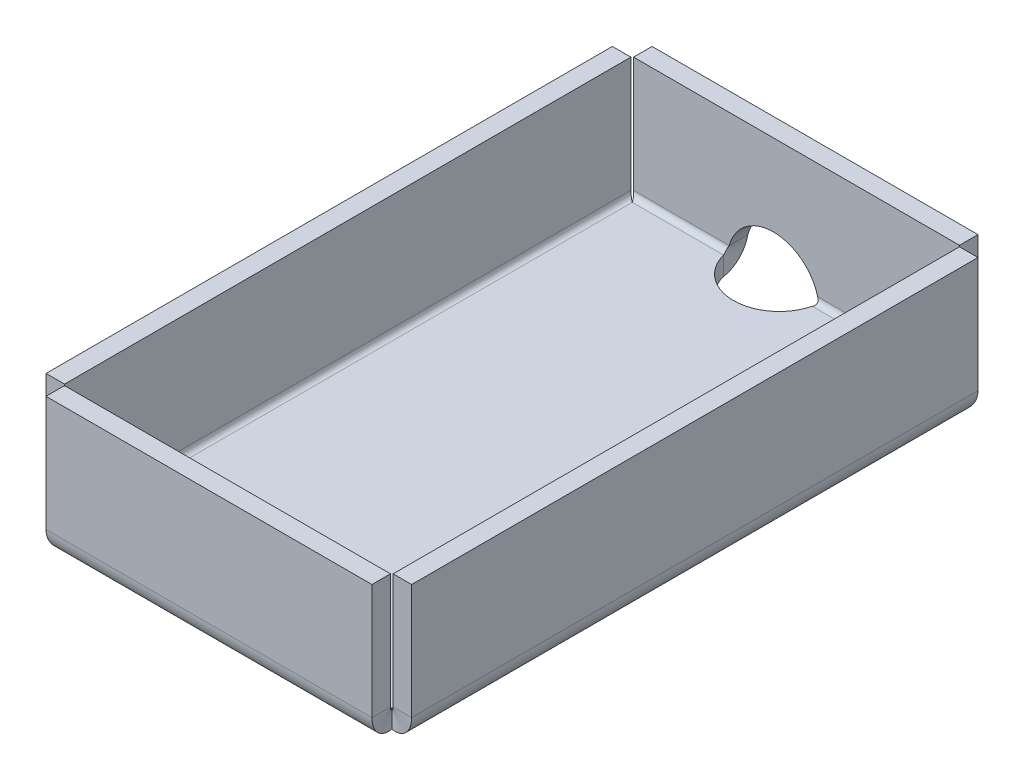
ISO-10303-21;
HEADER;
FILE_DESCRIPTION(('STEP AP214'),'2;1');
FILE_NAME('part.step','',(''),(''),'','','');
FILE_SCHEMA(('AUTOMOTIVE_DESIGN { 1 0 10303 214 1 1 1 1 }'));
ENDSEC;
DATA;
#1=APPLICATION_CONTEXT('core data for automotive mechanical design processes');
#2=APPLICATION_PROTOCOL_DEFINITION('international standard','automotive_design',2000,#1);
#3=PRODUCT_CONTEXT('',#1,'mechanical');
#4=PRODUCT('Part','Part','',(#3));
#5=PRODUCT_RELATED_PRODUCT_CATEGORY('part','',(#4));
#6=PRODUCT_DEFINITION_FORMATION('','',#4);
#7=PRODUCT_DEFINITION_CONTEXT('part definition',#1,'design');
#8=PRODUCT_DEFINITION('design','',#6,#7);
#9=PRODUCT_DEFINITION_SHAPE('','',#8);
#10=(LENGTH_UNIT() NAMED_UNIT(*) SI_UNIT(.MILLI.,.METRE.));
#11=(NAMED_UNIT(*) PLANE_ANGLE_UNIT() SI_UNIT($,.RADIAN.));
#12=(NAMED_UNIT(*) SI_UNIT($,.STERADIAN.) SOLID_ANGLE_UNIT());
#13=UNCERTAINTY_MEASURE_WITH_UNIT(LENGTH_MEASURE(1.E-05),#10,'distance_accuracy_value','');
#14=(GEOMETRIC_REPRESENTATION_CONTEXT(3) GLOBAL_UNCERTAINTY_ASSIGNED_CONTEXT((#13)) GLOBAL_UNIT_ASSIGNED_CONTEXT((#10,
#11,#12)) REPRESENTATION_CONTEXT('',''));
#15=CARTESIAN_POINT('',(0.,0.,0.));
#16=DIRECTION('',(0.,0.,1.));
#17=DIRECTION('',(1.,0.,0.));
#18=AXIS2_PLACEMENT_3D('',#15,#16,#17);
#19=CARTESIAN_POINT('',(0.,2.54,0.));
#20=DIRECTION('',(0.,1.,0.));
#21=DIRECTION('',(0.,0.,1.));
#22=AXIS2_PLACEMENT_3D('',#19,#20,#21);
#23=PLANE('',#22);
#24=CARTESIAN_POINT('',(18.6059177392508,2.54,-78.0777927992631));
#25=DIRECTION('',(0.,-1.,0.));
#26=DIRECTION('',(0.,0.,-1.));
#27=AXIS2_PLACEMENT_3D('',#24,#25,#26);
#28=CIRCLE('',#27,6.28060738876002);
#29=CARTESIAN_POINT('',(24.6894280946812,2.53999994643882,-76.5167255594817));
#30=VERTEX_POINT('',#29);
#31=CARTESIAN_POINT('',(12.5224073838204,2.53999994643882,-76.5167255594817));
#32=VERTEX_POINT('',#31);
#33=EDGE_CURVE('E568',#30,#32,#28,.T.);
#34=ORIENTED_EDGE('',*,*,#33,.T.);
#35=DIRECTION('',(-1.,0.,0.));
#36=VECTOR('',#35,1.);
#37=CARTESIAN_POINT('',(0.,2.54,-76.5167255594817));
#38=LINE('',#37,#36);
#39=CARTESIAN_POINT('',(3.11556336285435E-12,2.53999994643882,-76.5167255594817));
#40=VERTEX_POINT('',#39);
#41=EDGE_CURVE('E764',#32,#40,#38,.T.);
#42=ORIENTED_EDGE('',*,*,#41,.T.);
#43=DIRECTION('',(0.,0.,1.));
#44=VECTOR('',#43,1.);
#45=CARTESIAN_POINT('',(0.,2.54,-76.5167255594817));
#46=LINE('',#45,#44);
#47=CARTESIAN_POINT('',(0.,2.54,0.));
#48=VERTEX_POINT('',#47);
#49=EDGE_CURVE('E657',#40,#48,#46,.T.);
#50=ORIENTED_EDGE('',*,*,#49,.T.);
#51=DIRECTION('',(1.,0.,0.));
#52=VECTOR('',#51,1.);
#53=CARTESIAN_POINT('',(0.,2.54,0.));
#54=LINE('',#53,#52);
#55=CARTESIAN_POINT('',(43.5385731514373,2.54,0.));
#56=VERTEX_POINT('',#55);
#57=EDGE_CURVE('E118',#48,#56,#54,.T.);
#58=ORIENTED_EDGE('',*,*,#57,.T.);
#59=DIRECTION('',(0.,0.,-1.));
#60=VECTOR('',#59,1.);
#61=CARTESIAN_POINT('',(43.5385731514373,2.54,-76.5167255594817));
#62=LINE('',#61,#60);
#63=CARTESIAN_POINT('',(43.5385731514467,2.54,-76.5167255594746));
#64=VERTEX_POINT('',#63);
#65=EDGE_CURVE('E112',#56,#64,#62,.T.);
#66=ORIENTED_EDGE('',*,*,#65,.T.);
#67=DIRECTION('',(-1.,0.,0.));
#68=VECTOR('',#67,1.);
#69=CARTESIAN_POINT('',(0.,2.54,-76.5167255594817));
#70=LINE('',#69,#68);
#71=EDGE_CURVE('E664',#64,#30,#70,.T.);
#72=ORIENTED_EDGE('',*,*,#71,.T.);
#73=EDGE_LOOP('',(#34,#42,#50,#58,#66,#72));
#74=FACE_BOUND('',#73,.T.);
#75=ADVANCED_FACE('F80',(#74),#23,.T.);
#76=CARTESIAN_POINT('',(0.,0.,0.));
#77=DIRECTION('',(0.,1.,0.));
#78=DIRECTION('',(0.,0.,1.));
#79=AXIS2_PLACEMENT_3D('',#76,#77,#78);
#80=PLANE('',#79);
#81=DIRECTION('',(-1.,0.,0.));
#82=VECTOR('',#81,1.);
#83=CARTESIAN_POINT('',(0.,0.,-76.5167255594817));
#84=LINE('',#83,#82);
#85=CARTESIAN_POINT('',(12.5224073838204,-5.35611754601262E-08,-76.5167255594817));
#86=VERTEX_POINT('',#85);
#87=CARTESIAN_POINT('',(1.11559182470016E-10,0.,-76.5167255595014));
#88=VERTEX_POINT('',#87);
#89=EDGE_CURVE('E93',#86,#88,#84,.T.);
#90=ORIENTED_EDGE('',*,*,#89,.F.);
#91=CARTESIAN_POINT('',(18.6059177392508,0.,-78.0777927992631));
#92=DIRECTION('',(0.,-1.,0.));
#93=DIRECTION('',(0.,0.,-1.));
#94=AXIS2_PLACEMENT_3D('',#91,#92,#93);
#95=CIRCLE('',#94,6.28060738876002);
#96=CARTESIAN_POINT('',(24.6894280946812,0.,-76.5167255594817));
#97=VERTEX_POINT('',#96);
#98=EDGE_CURVE('E671',#97,#86,#95,.T.);
#99=ORIENTED_EDGE('',*,*,#98,.F.);
#100=DIRECTION('',(-1.,0.,0.));
#101=VECTOR('',#100,1.);
#102=CARTESIAN_POINT('',(0.,0.,-76.5167255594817));
#103=LINE('',#102,#101);
#104=CARTESIAN_POINT('',(43.5385731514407,0.,-76.5167255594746));
#105=VERTEX_POINT('',#104);
#106=EDGE_CURVE('E682',#105,#97,#103,.T.);
#107=ORIENTED_EDGE('',*,*,#106,.F.);
#108=DIRECTION('',(0.,0.,-1.));
#109=VECTOR('',#108,1.);
#110=CARTESIAN_POINT('',(43.5385731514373,0.,-76.5167255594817));
#111=LINE('',#110,#109);
#112=CARTESIAN_POINT('',(43.5385731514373,0.,0.));
#113=VERTEX_POINT('',#112);
#114=EDGE_CURVE('E655',#113,#105,#111,.T.);
#115=ORIENTED_EDGE('',*,*,#114,.F.);
#116=DIRECTION('',(1.,0.,0.));
#117=VECTOR('',#116,1.);
#118=CARTESIAN_POINT('',(0.,0.,0.));
#119=LINE('',#118,#117);
#120=CARTESIAN_POINT('',(1.18793863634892E-11,0.,0.));
#121=VERTEX_POINT('',#120);
#122=EDGE_CURVE('E652',#121,#113,#119,.T.);
#123=ORIENTED_EDGE('',*,*,#122,.F.);
#124=DIRECTION('',(0.,0.,1.));
#125=VECTOR('',#124,1.);
#126=CARTESIAN_POINT('',(0.,0.,-76.5167255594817));
#127=LINE('',#126,#125);
#128=EDGE_CURVE('E649',#88,#121,#127,.T.);
#129=ORIENTED_EDGE('',*,*,#128,.F.);
#130=EDGE_LOOP('',(#90,#99,#107,#115,#123,#129));
#131=FACE_BOUND('',#130,.T.);
#132=ADVANCED_FACE('F752',(#131),#80,.F.);
#133=CARTESIAN_POINT('',(44.3005731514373,19.1213354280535,382.583627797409));
#134=DIRECTION('',(0.,-1.,0.));
#135=DIRECTION('',(0.,0.,-1.));
#136=AXIS2_PLACEMENT_3D('',#133,#134,#135);
#137=PLANE('',#136);
#138=DIRECTION('',(1.,0.,0.));
#139=VECTOR('',#138,1.);
#140=CARTESIAN_POINT('',(44.3005731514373,19.1213354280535,-77.0991204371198));
#141=LINE('',#140,#139);
#142=CARTESIAN_POINT('',(44.3005731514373,19.1213354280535,-77.0991204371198));
#143=VERTEX_POINT('',#142);
#144=CARTESIAN_POINT('',(46.8405731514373,19.1213354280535,-77.0991204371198));
#145=VERTEX_POINT('',#144);
#146=EDGE_CURVE('E647',#143,#145,#141,.T.);
#147=ORIENTED_EDGE('',*,*,#146,.F.);
#148=DIRECTION('',(0.,0.,-1.));
#149=VECTOR('',#148,1.);
#150=CARTESIAN_POINT('',(44.3005731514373,19.1213354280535,382.583627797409));
#151=LINE('',#150,#149);
#152=CARTESIAN_POINT('',(44.3005731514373,19.1213354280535,0.58239487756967));
#153=VERTEX_POINT('',#152);
#154=EDGE_CURVE('E623',#153,#143,#151,.T.);
#155=ORIENTED_EDGE('',*,*,#154,.F.);
#156=DIRECTION('',(1.,0.,0.));
#157=VECTOR('',#156,1.);
#158=CARTESIAN_POINT('',(44.3005731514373,19.1213354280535,0.58239487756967));
#159=LINE('',#158,#157);
#160=CARTESIAN_POINT('',(46.8405731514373,19.1213354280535,0.58239487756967));
#161=VERTEX_POINT('',#160);
#162=EDGE_CURVE('E645',#153,#161,#159,.T.);
#163=ORIENTED_EDGE('',*,*,#162,.T.);
#164=DIRECTION('',(0.,0.,-1.));
#165=VECTOR('',#164,1.);
#166=CARTESIAN_POINT('',(46.8405731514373,19.1213354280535,382.583627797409));
#167=LINE('',#166,#165);
#168=EDGE_CURVE('E631',#161,#145,#167,.T.);
#169=ORIENTED_EDGE('',*,*,#168,.T.);
#170=EDGE_LOOP('',(#147,#155,#163,#169));
#171=FACE_BOUND('',#170,.T.);
#172=ADVANCED_FACE('F748',(#171),#137,.F.);
#173=CARTESIAN_POINT('',(44.3005731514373,19.1213354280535,0.58239487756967));
#174=DIRECTION('',(0.,0.,-1.));
#175=DIRECTION('',(0.,1.,0.));
#176=AXIS2_PLACEMENT_3D('',#173,#174,#175);
#177=PLANE('',#176);
#178=ORIENTED_EDGE('',*,*,#162,.F.);
#179=DIRECTION('',(0.,1.,0.));
#180=VECTOR('',#179,1.);
#181=CARTESIAN_POINT('',(44.3005731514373,19.1213354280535,0.58239487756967));
#182=LINE('',#181,#180);
#183=CARTESIAN_POINT('',(44.3005731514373,3.302,0.58239487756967));
#184=VERTEX_POINT('',#183);
#185=EDGE_CURVE('E622',#153,#184,#182,.F.);
#186=ORIENTED_EDGE('',*,*,#185,.T.);
#187=DIRECTION('',(1.,0.,0.));
#188=VECTOR('',#187,1.);
#189=CARTESIAN_POINT('',(44.3005731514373,3.302,0.58239487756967));
#190=LINE('',#189,#188);
#191=CARTESIAN_POINT('',(46.8405731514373,3.302,0.58239487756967));
#192=VERTEX_POINT('',#191);
#193=EDGE_CURVE('E643',#184,#192,#190,.T.);
#194=ORIENTED_EDGE('',*,*,#193,.T.);
#195=DIRECTION('',(0.,1.,0.));
#196=VECTOR('',#195,1.);
#197=CARTESIAN_POINT('',(46.8405731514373,19.1213354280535,0.58239487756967));
#198=LINE('',#197,#196);
#199=EDGE_CURVE('E634',#161,#192,#198,.F.);
#200=ORIENTED_EDGE('',*,*,#199,.F.);
#201=EDGE_LOOP('',(#178,#186,#194,#200));
#202=FACE_BOUND('',#201,.T.);
#203=ADVANCED_FACE('F745',(#202),#177,.F.);
#204=CARTESIAN_POINT('',(44.3005731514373,19.1213354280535,-77.0991204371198));
#205=DIRECTION('',(0.,0.,-1.));
#206=DIRECTION('',(0.,1.,0.));
#207=AXIS2_PLACEMENT_3D('',#204,#205,#206);
#208=PLANE('',#207);
#209=DIRECTION('',(0.,1.,0.));
#210=VECTOR('',#209,1.);
#211=CARTESIAN_POINT('',(44.3005731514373,19.1213354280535,-77.0991204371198));
#212=LINE('',#211,#210);
#213=CARTESIAN_POINT('',(44.3005731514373,3.302,-77.0991204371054));
#214=VERTEX_POINT('',#213);
#215=EDGE_CURVE('E626',#214,#143,#212,.T.);
#216=ORIENTED_EDGE('',*,*,#215,.T.);
#217=ORIENTED_EDGE('',*,*,#146,.T.);
#218=DIRECTION('',(0.,1.,0.));
#219=VECTOR('',#218,1.);
#220=CARTESIAN_POINT('',(46.8405731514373,19.1213354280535,-77.0991204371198));
#221=LINE('',#220,#219);
#222=CARTESIAN_POINT('',(46.8405731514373,3.302,-77.0991204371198));
#223=VERTEX_POINT('',#222);
#224=EDGE_CURVE('E637',#223,#145,#221,.T.);
#225=ORIENTED_EDGE('',*,*,#224,.F.);
#226=DIRECTION('',(1.,0.,0.));
#227=VECTOR('',#226,1.);
#228=CARTESIAN_POINT('',(44.3005731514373,3.302,-77.0991204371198));
#229=LINE('',#228,#227);
#230=EDGE_CURVE('E642',#214,#223,#229,.T.);
#231=ORIENTED_EDGE('',*,*,#230,.F.);
#232=EDGE_LOOP('',(#216,#217,#225,#231));
#233=FACE_BOUND('',#232,.T.);
#234=ADVANCED_FACE('F741',(#233),#208,.T.);
#235=CARTESIAN_POINT('',(46.8405731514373,19.1213354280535,382.583627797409));
#236=DIRECTION('',(1.,0.,0.));
#237=DIRECTION('',(0.,0.,-1.));
#238=AXIS2_PLACEMENT_3D('',#235,#236,#237);
#239=PLANE('',#238);
#240=DIRECTION('',(0.,0.,-1.));
#241=VECTOR('',#240,1.);
#242=CARTESIAN_POINT('',(46.8405731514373,3.302,382.583627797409));
#243=LINE('',#242,#241);
#244=EDGE_CURVE('E632',#192,#223,#243,.T.);
#245=ORIENTED_EDGE('',*,*,#244,.T.);
#246=ORIENTED_EDGE('',*,*,#224,.T.);
#247=ORIENTED_EDGE('',*,*,#168,.F.);
#248=ORIENTED_EDGE('',*,*,#199,.T.);
#249=EDGE_LOOP('',(#245,#246,#247,#248));
#250=FACE_BOUND('',#249,.T.);
#251=ADVANCED_FACE('F739',(#250),#239,.T.);
#252=CARTESIAN_POINT('',(44.3005731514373,19.1213354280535,382.583627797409));
#253=DIRECTION('',(1.,0.,0.));
#254=DIRECTION('',(0.,0.,-1.));
#255=AXIS2_PLACEMENT_3D('',#252,#253,#254);
#256=PLANE('',#255);
#257=DIRECTION('',(0.,0.,-1.));
#258=VECTOR('',#257,1.);
#259=CARTESIAN_POINT('',(44.3005731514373,3.302,382.583627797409));
#260=LINE('',#259,#258);
#261=EDGE_CURVE('E619',#184,#214,#260,.T.);
#262=ORIENTED_EDGE('',*,*,#261,.F.);
#263=ORIENTED_EDGE('',*,*,#185,.F.);
#264=ORIENTED_EDGE('',*,*,#154,.T.);
#265=ORIENTED_EDGE('',*,*,#215,.F.);
#266=EDGE_LOOP('',(#262,#263,#264,#265));
#267=FACE_BOUND('',#266,.T.);
#268=ADVANCED_FACE('F731',(#267),#256,.F.);
#269=CARTESIAN_POINT('',(40.2365731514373,3.302,-0.582394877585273));
#270=CARTESIAN_POINT('',(41.0832398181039,3.302,-0.582394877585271));
#271=CARTESIAN_POINT('',(41.9299064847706,3.302,-0.58239487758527));
#272=CARTESIAN_POINT('',(42.7765731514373,3.302,-0.582394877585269));
#273=CARTESIAN_POINT('',(40.2365731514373,9.906,-0.582394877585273));
#274=CARTESIAN_POINT('',(41.0832398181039,8.21266666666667,-0.582394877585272));
#275=CARTESIAN_POINT('',(41.9299064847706,6.51933333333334,-0.58239487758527));
#276=CARTESIAN_POINT('',(42.7765731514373,4.826,-0.582394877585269));
#277=CARTESIAN_POINT('',(46.8405731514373,9.906,0.582394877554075));
#278=CARTESIAN_POINT('',(45.9939064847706,8.21266666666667,0.582394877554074));
#279=CARTESIAN_POINT('',(45.1472398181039,6.51933333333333,0.582394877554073));
#280=CARTESIAN_POINT('',(44.3005731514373,4.826,0.582394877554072));
#281=CARTESIAN_POINT('',(46.8405731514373,3.302,0.582394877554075));
#282=CARTESIAN_POINT('',(45.9939064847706,3.302,0.582394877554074));
#283=CARTESIAN_POINT('',(45.1472398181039,3.302,0.582394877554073));
#284=CARTESIAN_POINT('',(44.3005731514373,3.302,0.582394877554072));
#285=CARTESIAN_POINT('',(46.8405731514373,-3.302,0.582394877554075));
#286=CARTESIAN_POINT('',(45.9939064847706,-1.60866666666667,0.582394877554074));
#287=CARTESIAN_POINT('',(45.1472398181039,0.0846666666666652,0.582394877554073));
#288=CARTESIAN_POINT('',(44.3005731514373,1.778,0.582394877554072));
#289=CARTESIAN_POINT('',(40.2365731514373,-3.302,-0.582394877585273));
#290=CARTESIAN_POINT('',(41.0832398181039,-1.60866666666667,-0.582394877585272));
#291=CARTESIAN_POINT('',(41.9299064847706,0.0846666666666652,-0.58239487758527));
#292=CARTESIAN_POINT('',(42.7765731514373,1.778,-0.582394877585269));
#293=CARTESIAN_POINT('',(40.2365731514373,3.302,-0.582394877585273));
#294=CARTESIAN_POINT('',(41.0832398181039,3.302,-0.582394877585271));
#295=CARTESIAN_POINT('',(41.9299064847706,3.302,-0.58239487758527));
#296=CARTESIAN_POINT('',(42.7765731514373,3.302,-0.582394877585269));
#297=(BOUNDED_SURFACE() B_SPLINE_SURFACE(3,3,((#269,#270,#271,#272),(#273,#274,#275,#276),(#277,
#278,#279,#280),(#281,#282,#283,#284),(#285,#286,#287,#288),(#289,#290,#291,#292),(#293,#294,
#295,#296)),.UNSPECIFIED.,.T.,.F.,.F.) B_SPLINE_SURFACE_WITH_KNOTS((4,3,4),(4,4),(0.,0.5,1.),
(0.,1.),.UNSPECIFIED.) GEOMETRIC_REPRESENTATION_ITEM() RATIONAL_B_SPLINE_SURFACE(((1.,1.,1.,1.),
(0.333333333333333,0.333333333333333,0.333333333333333,0.333333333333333),(0.333333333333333,
0.333333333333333,0.333333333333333,0.333333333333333),(1.,1.,1.,1.),(0.333333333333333,
0.333333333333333,0.333333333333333,0.333333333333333),(0.333333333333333,0.333333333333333,
0.333333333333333,0.333333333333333),(1.,1.,1.,1.))) REPRESENTATION_ITEM('') SURFACE());
#298=CARTESIAN_POINT('',(43.5385731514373,3.302,-1.55986334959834E-11));
#299=DIRECTION('',(-0.607245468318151,0.,0.794514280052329));
#300=DIRECTION('',(-0.794514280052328,0.,-0.607245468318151));
#301=AXIS2_PLACEMENT_3D('',#298,#299,#300);
#302=ELLIPSE('',#301,0.959076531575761,0.762);
#303=EDGE_CURVE('E606',#184,#56,#302,.F.);
#304=DIRECTION('',(0.,-1.,0.));
#305=VECTOR('',#304,1.);
#306=CARTESIAN_POINT('',(43.5385731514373,2.54,0.));
#307=LINE('',#306,#305);
#308=EDGE_CURVE('E658',#56,#113,#307,.T.);
#309=CARTESIAN_POINT('',(43.5385731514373,3.302,-1.55986334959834E-11));
#310=DIRECTION('',(-0.173695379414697,0.,0.984799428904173));
#311=DIRECTION('',(-0.984799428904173,0.,-0.173695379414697));
#312=AXIS2_PLACEMENT_3D('',#309,#310,#311);
#313=ELLIPSE('',#312,3.35296701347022,3.302);
#314=EDGE_CURVE('E615',#192,#113,#313,.F.);
#315=ORIENTED_EDGE('',*,*,#193,.F.);
#316=ORIENTED_EDGE('',*,*,#303,.T.);
#317=ORIENTED_EDGE('',*,*,#308,.T.);
#318=ORIENTED_EDGE('',*,*,#314,.F.);
#319=EDGE_LOOP('',(#315,#316,#317,#318));
#320=FACE_BOUND('',#319,.T.);
#321=ADVANCED_FACE('F726',(#320),#297,.F.);
#322=CARTESIAN_POINT('',(46.8405731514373,3.302,-77.0991204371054));
#323=CARTESIAN_POINT('',(45.9939064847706,3.302,-77.0991204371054));
#324=CARTESIAN_POINT('',(45.1472398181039,3.302,-77.0991204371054));
#325=CARTESIAN_POINT('',(44.3005731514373,3.302,-77.0991204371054));
#326=CARTESIAN_POINT('',(46.8405731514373,9.906,-77.0991204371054));
#327=CARTESIAN_POINT('',(45.9939064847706,8.21266666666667,-77.0991204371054));
#328=CARTESIAN_POINT('',(45.1472398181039,6.51933333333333,-77.0991204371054));
#329=CARTESIAN_POINT('',(44.3005731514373,4.826,-77.0991204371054));
#330=CARTESIAN_POINT('',(40.2365731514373,9.906,-75.9343306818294));
#331=CARTESIAN_POINT('',(41.0832398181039,8.21266666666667,-75.9343306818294));
#332=CARTESIAN_POINT('',(41.9299064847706,6.51933333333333,-75.9343306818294));
#333=CARTESIAN_POINT('',(42.7765731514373,4.826,-75.9343306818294));
#334=CARTESIAN_POINT('',(40.2365731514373,3.302,-75.9343306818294));
#335=CARTESIAN_POINT('',(41.0832398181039,3.302,-75.9343306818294));
#336=CARTESIAN_POINT('',(41.9299064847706,3.302,-75.9343306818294));
#337=CARTESIAN_POINT('',(42.7765731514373,3.302,-75.9343306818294));
#338=CARTESIAN_POINT('',(40.2365731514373,-3.302,-75.9343306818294));
#339=CARTESIAN_POINT('',(41.0832398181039,-1.60866666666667,-75.9343306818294));
#340=CARTESIAN_POINT('',(41.9299064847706,0.0846666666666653,-75.9343306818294));
#341=CARTESIAN_POINT('',(42.7765731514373,1.778,-75.9343306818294));
#342=CARTESIAN_POINT('',(46.8405731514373,-3.302,-77.0991204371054));
#343=CARTESIAN_POINT('',(45.9939064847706,-1.60866666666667,-77.0991204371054));
#344=CARTESIAN_POINT('',(45.1472398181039,0.0846666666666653,-77.0991204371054));
#345=CARTESIAN_POINT('',(44.3005731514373,1.778,-77.0991204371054));
#346=CARTESIAN_POINT('',(46.8405731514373,3.302,-77.0991204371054));
#347=CARTESIAN_POINT('',(45.9939064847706,3.302,-77.0991204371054));
#348=CARTESIAN_POINT('',(45.1472398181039,3.302,-77.0991204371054));
#349=CARTESIAN_POINT('',(44.3005731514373,3.302,-77.0991204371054));
#350=(BOUNDED_SURFACE() B_SPLINE_SURFACE(3,3,((#322,#323,#324,#325),(#326,#327,#328,#329),(#330,
#331,#332,#333),(#334,#335,#336,#337),(#338,#339,#340,#341),(#342,#343,#344,#345),(#346,#347,
#348,#349)),.UNSPECIFIED.,.T.,.F.,.F.) B_SPLINE_SURFACE_WITH_KNOTS((4,3,4),(4,4),(0.,0.5,1.),
(0.,1.),.UNSPECIFIED.) GEOMETRIC_REPRESENTATION_ITEM() RATIONAL_B_SPLINE_SURFACE(((1.,1.,1.,1.),
(0.333333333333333,0.333333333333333,0.333333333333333,0.333333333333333),(0.333333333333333,
0.333333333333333,0.333333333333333,0.333333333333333),(1.,1.,1.,1.),(0.333333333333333,
0.333333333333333,0.333333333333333,0.333333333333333),(0.333333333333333,0.333333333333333,
0.333333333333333,0.333333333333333),(1.,1.,1.,1.))) REPRESENTATION_ITEM('') SURFACE());
#351=CARTESIAN_POINT('',(43.5385731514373,3.302,-76.5167255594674));
#352=DIRECTION('',(-0.607245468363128,0.,-0.794514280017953));
#353=DIRECTION('',(0.794514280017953,0.,-0.607245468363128));
#354=AXIS2_PLACEMENT_3D('',#351,#352,#353);
#355=ELLIPSE('',#354,0.959076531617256,0.762);
#356=EDGE_CURVE('E614',#64,#214,#355,.F.);
#357=CARTESIAN_POINT('',(43.5385731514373,3.302,-76.5167255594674));
#358=DIRECTION('',(-0.173695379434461,0.,-0.984799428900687));
#359=DIRECTION('',(0.984799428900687,0.,-0.173695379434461));
#360=AXIS2_PLACEMENT_3D('',#357,#358,#359);
#361=ELLIPSE('',#360,3.35296701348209,3.302);
#362=EDGE_CURVE('E618',#105,#223,#361,.F.);
#363=CARTESIAN_POINT('',(43.5385731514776,2.53999994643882,-76.5167255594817));
#364=CARTESIAN_POINT('',(43.5385731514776,-5.35611754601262E-08,-76.5167255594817));
#365=B_SPLINE_CURVE_WITH_KNOTS('',1,(#363,#364),.UNSPECIFIED.,.F.,.F.,(2,2),(0.,1.),.UNSPECIFIED.);
#366=EDGE_CURVE('E666',#64,#105,#365,.T.);
#367=ORIENTED_EDGE('',*,*,#356,.T.);
#368=ORIENTED_EDGE('',*,*,#230,.T.);
#369=ORIENTED_EDGE('',*,*,#362,.F.);
#370=ORIENTED_EDGE('',*,*,#366,.F.);
#371=EDGE_LOOP('',(#367,#368,#369,#370));
#372=FACE_BOUND('',#371,.T.);
#373=ADVANCED_FACE('F713',(#372),#350,.F.);
#374=CARTESIAN_POINT('',(43.5385731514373,3.302,382.583627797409));
#375=DIRECTION('',(0.,0.,-1.));
#376=DIRECTION('',(-1.,0.,0.));
#377=AXIS2_PLACEMENT_3D('',#374,#375,#376);
#378=CYLINDRICAL_SURFACE('',#377,3.302);
#379=ORIENTED_EDGE('',*,*,#114,.T.);
#380=ORIENTED_EDGE('',*,*,#362,.T.);
#381=ORIENTED_EDGE('',*,*,#244,.F.);
#382=ORIENTED_EDGE('',*,*,#314,.T.);
#383=EDGE_LOOP('',(#379,#380,#381,#382));
#384=FACE_BOUND('',#383,.T.);
#385=ADVANCED_FACE('F725',(#384),#378,.T.);
#386=CARTESIAN_POINT('',(43.5385731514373,3.302,382.583627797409));
#387=DIRECTION('',(0.,0.,-1.));
#388=DIRECTION('',(-1.,0.,0.));
#389=AXIS2_PLACEMENT_3D('',#386,#387,#388);
#390=CYLINDRICAL_SURFACE('',#389,0.762);
#391=ORIENTED_EDGE('',*,*,#65,.F.);
#392=ORIENTED_EDGE('',*,*,#303,.F.);
#393=ORIENTED_EDGE('',*,*,#261,.T.);
#394=ORIENTED_EDGE('',*,*,#356,.F.);
#395=EDGE_LOOP('',(#391,#392,#393,#394));
#396=FACE_BOUND('',#395,.T.);
#397=ADVANCED_FACE('F727',(#396),#390,.F.);
#398=CARTESIAN_POINT('',(-0.76200000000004,19.1213354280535,-459.10035335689));
#399=DIRECTION('',(0.,-1.,0.));
#400=DIRECTION('',(0.,0.,1.));
#401=AXIS2_PLACEMENT_3D('',#398,#399,#400);
#402=PLANE('',#401);
#403=DIRECTION('',(-1.,0.,0.));
#404=VECTOR('',#403,1.);
#405=CARTESIAN_POINT('',(-0.762000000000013,19.1213354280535,0.582394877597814));
#406=LINE('',#405,#404);
#407=CARTESIAN_POINT('',(-0.762000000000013,19.1213354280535,0.582394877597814));
#408=VERTEX_POINT('',#407);
#409=CARTESIAN_POINT('',(-3.30200000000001,19.1213354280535,0.582394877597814));
#410=VERTEX_POINT('',#409);
#411=EDGE_CURVE('E577',#408,#410,#406,.T.);
#412=ORIENTED_EDGE('',*,*,#411,.F.);
#413=DIRECTION('',(0.,0.,1.));
#414=VECTOR('',#413,1.);
#415=CARTESIAN_POINT('',(-0.76200000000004,19.1213354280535,-459.10035335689));
#416=LINE('',#415,#414);
#417=CARTESIAN_POINT('',(-0.762000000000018,19.1213354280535,-77.0991204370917));
#418=VERTEX_POINT('',#417);
#419=EDGE_CURVE('E594',#418,#408,#416,.T.);
#420=ORIENTED_EDGE('',*,*,#419,.F.);
#421=DIRECTION('',(-1.,0.,0.));
#422=VECTOR('',#421,1.);
#423=CARTESIAN_POINT('',(-0.762000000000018,19.1213354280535,-77.0991204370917));
#424=LINE('',#423,#422);
#425=CARTESIAN_POINT('',(-3.30200000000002,19.1213354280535,-77.0991204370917));
#426=VERTEX_POINT('',#425);
#427=EDGE_CURVE('E543',#418,#426,#424,.T.);
#428=ORIENTED_EDGE('',*,*,#427,.T.);
#429=DIRECTION('',(0.,0.,1.));
#430=VECTOR('',#429,1.);
#431=CARTESIAN_POINT('',(-3.30200000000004,19.1213354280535,-459.10035335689));
#432=LINE('',#431,#430);
#433=EDGE_CURVE('E582',#426,#410,#432,.T.);
#434=ORIENTED_EDGE('',*,*,#433,.T.);
#435=EDGE_LOOP('',(#412,#420,#428,#434));
#436=FACE_BOUND('',#435,.T.);
#437=ADVANCED_FACE('F979',(#436),#402,.F.);
#438=CARTESIAN_POINT('',(-0.762000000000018,19.1213354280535,-77.0991204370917));
#439=DIRECTION('',(0.,0.,1.));
#440=DIRECTION('',(0.,1.,0.));
#441=AXIS2_PLACEMENT_3D('',#438,#439,#440);
#442=PLANE('',#441);
#443=ORIENTED_EDGE('',*,*,#427,.F.);
#444=DIRECTION('',(0.,1.,0.));
#445=VECTOR('',#444,1.);
#446=CARTESIAN_POINT('',(-0.762000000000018,19.1213354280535,-77.0991204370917));
#447=LINE('',#446,#445);
#448=CARTESIAN_POINT('',(-0.762000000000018,3.302,-77.0991204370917));
#449=VERTEX_POINT('',#448);
#450=EDGE_CURVE('E585',#418,#449,#447,.F.);
#451=ORIENTED_EDGE('',*,*,#450,.T.);
#452=DIRECTION('',(-1.,0.,0.));
#453=VECTOR('',#452,1.);
#454=CARTESIAN_POINT('',(-0.762000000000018,3.302,-77.0991204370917));
#455=LINE('',#454,#453);
#456=CARTESIAN_POINT('',(-3.30200000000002,3.302,-77.0991204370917));
#457=VERTEX_POINT('',#456);
#458=EDGE_CURVE('E583',#449,#457,#455,.T.);
#459=ORIENTED_EDGE('',*,*,#458,.T.);
#460=DIRECTION('',(0.,1.,0.));
#461=VECTOR('',#460,1.);
#462=CARTESIAN_POINT('',(-3.30200000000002,19.1213354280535,-77.0991204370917));
#463=LINE('',#462,#461);
#464=EDGE_CURVE('E589',#426,#457,#463,.F.);
#465=ORIENTED_EDGE('',*,*,#464,.F.);
#466=EDGE_LOOP('',(#443,#451,#459,#465));
#467=FACE_BOUND('',#466,.T.);
#468=ADVANCED_FACE('F976',(#467),#442,.F.);
#469=CARTESIAN_POINT('',(-0.762000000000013,19.1213354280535,0.582394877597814));
#470=DIRECTION('',(0.,0.,1.));
#471=DIRECTION('',(0.,1.,0.));
#472=AXIS2_PLACEMENT_3D('',#469,#470,#471);
#473=PLANE('',#472);
#474=DIRECTION('',(0.,1.,0.));
#475=VECTOR('',#474,1.);
#476=CARTESIAN_POINT('',(-0.762000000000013,19.1213354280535,0.582394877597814));
#477=LINE('',#476,#475);
#478=CARTESIAN_POINT('',(-0.762000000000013,3.302,0.582394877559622));
#479=VERTEX_POINT('',#478);
#480=EDGE_CURVE('E580',#479,#408,#477,.T.);
#481=ORIENTED_EDGE('',*,*,#480,.T.);
#482=ORIENTED_EDGE('',*,*,#411,.T.);
#483=DIRECTION('',(0.,1.,0.));
#484=VECTOR('',#483,1.);
#485=CARTESIAN_POINT('',(-3.30200000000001,19.1213354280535,0.582394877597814));
#486=LINE('',#485,#484);
#487=CARTESIAN_POINT('',(-3.30200000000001,3.302,0.582394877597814));
#488=VERTEX_POINT('',#487);
#489=EDGE_CURVE('E586',#488,#410,#486,.T.);
#490=ORIENTED_EDGE('',*,*,#489,.F.);
#491=DIRECTION('',(-1.,0.,0.));
#492=VECTOR('',#491,1.);
#493=CARTESIAN_POINT('',(-0.762000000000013,3.302,0.582394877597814));
#494=LINE('',#493,#492);
#495=EDGE_CURVE('E572',#479,#488,#494,.T.);
#496=ORIENTED_EDGE('',*,*,#495,.F.);
#497=EDGE_LOOP('',(#481,#482,#490,#496));
#498=FACE_BOUND('',#497,.T.);
#499=ADVANCED_FACE('F972',(#498),#473,.T.);
#500=CARTESIAN_POINT('',(-3.30200000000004,19.1213354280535,-459.10035335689));
#501=DIRECTION('',(-1.,0.,0.));
#502=DIRECTION('',(0.,0.,1.));
#503=AXIS2_PLACEMENT_3D('',#500,#501,#502);
#504=PLANE('',#503);
#505=DIRECTION('',(0.,0.,1.));
#506=VECTOR('',#505,1.);
#507=CARTESIAN_POINT('',(-3.30200000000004,3.302,-459.10035335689));
#508=LINE('',#507,#506);
#509=EDGE_CURVE('E579',#457,#488,#508,.T.);
#510=ORIENTED_EDGE('',*,*,#509,.T.);
#511=ORIENTED_EDGE('',*,*,#489,.T.);
#512=ORIENTED_EDGE('',*,*,#433,.F.);
#513=ORIENTED_EDGE('',*,*,#464,.T.);
#514=EDGE_LOOP('',(#510,#511,#512,#513));
#515=FACE_BOUND('',#514,.T.);
#516=ADVANCED_FACE('F975',(#515),#504,.T.);
#517=CARTESIAN_POINT('',(-0.76200000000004,19.1213354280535,-459.10035335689));
#518=DIRECTION('',(-1.,0.,0.));
#519=DIRECTION('',(0.,0.,1.));
#520=AXIS2_PLACEMENT_3D('',#517,#518,#519);
#521=PLANE('',#520);
#522=DIRECTION('',(0.,0.,1.));
#523=VECTOR('',#522,1.);
#524=CARTESIAN_POINT('',(-0.76200000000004,3.302,-459.10035335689));
#525=LINE('',#524,#523);
#526=EDGE_CURVE('E603',#449,#479,#525,.T.);
#527=ORIENTED_EDGE('',*,*,#526,.F.);
#528=ORIENTED_EDGE('',*,*,#450,.F.);
#529=ORIENTED_EDGE('',*,*,#419,.T.);
#530=ORIENTED_EDGE('',*,*,#480,.F.);
#531=EDGE_LOOP('',(#527,#528,#529,#530));
#532=FACE_BOUND('',#531,.T.);
#533=ADVANCED_FACE('F978',(#532),#521,.F.);
#534=CARTESIAN_POINT('',(3.30199999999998,3.302,-75.9343306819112));
#535=CARTESIAN_POINT('',(2.45533333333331,3.302,-75.9343306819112));
#536=CARTESIAN_POINT('',(1.60866666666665,3.302,-75.9343306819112));
#537=CARTESIAN_POINT('',(0.761999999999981,3.302,-75.9343306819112));
#538=CARTESIAN_POINT('',(3.30199999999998,9.906,-75.9343306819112));
#539=CARTESIAN_POINT('',(2.45533333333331,8.21266666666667,-75.9343306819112));
#540=CARTESIAN_POINT('',(1.60866666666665,6.51933333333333,-75.9343306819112));
#541=CARTESIAN_POINT('',(0.761999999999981,4.826,-75.9343306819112));
#542=CARTESIAN_POINT('',(-3.30200000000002,9.906,-77.099120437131));
#543=CARTESIAN_POINT('',(-2.45533333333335,8.21266666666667,-77.099120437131));
#544=CARTESIAN_POINT('',(-1.60866666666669,6.51933333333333,-77.099120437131));
#545=CARTESIAN_POINT('',(-0.762000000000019,4.826,-77.099120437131));
#546=CARTESIAN_POINT('',(-3.30200000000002,3.302,-77.099120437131));
#547=CARTESIAN_POINT('',(-2.45533333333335,3.302,-77.099120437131));
#548=CARTESIAN_POINT('',(-1.60866666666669,3.302,-77.099120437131));
#549=CARTESIAN_POINT('',(-0.762000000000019,3.302,-77.099120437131));
#550=CARTESIAN_POINT('',(-3.30200000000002,-3.302,-77.099120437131));
#551=CARTESIAN_POINT('',(-2.45533333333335,-1.60866666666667,-77.099120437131));
#552=CARTESIAN_POINT('',(-1.60866666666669,0.0846666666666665,-77.099120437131));
#553=CARTESIAN_POINT('',(-0.762000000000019,1.778,-77.099120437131));
#554=CARTESIAN_POINT('',(3.30199999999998,-3.302,-75.9343306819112));
#555=CARTESIAN_POINT('',(2.45533333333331,-1.60866666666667,-75.9343306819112));
#556=CARTESIAN_POINT('',(1.60866666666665,0.0846666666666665,-75.9343306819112));
#557=CARTESIAN_POINT('',(0.761999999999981,1.778,-75.9343306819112));
#558=CARTESIAN_POINT('',(3.30199999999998,3.302,-75.9343306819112));
#559=CARTESIAN_POINT('',(2.45533333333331,3.302,-75.9343306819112));
#560=CARTESIAN_POINT('',(1.60866666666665,3.302,-75.9343306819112));
#561=CARTESIAN_POINT('',(0.761999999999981,3.302,-75.9343306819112));
#562=(BOUNDED_SURFACE() B_SPLINE_SURFACE(3,3,((#534,#535,#536,#537),(#538,#539,#540,#541),(#542,
#543,#544,#545),(#546,#547,#548,#549),(#550,#551,#552,#553),(#554,#555,#556,#557),(#558,#559,
#560,#561)),.UNSPECIFIED.,.T.,.F.,.F.) B_SPLINE_SURFACE_WITH_KNOTS((4,3,4),(4,4),(0.,0.5,1.),
(0.,1.),.UNSPECIFIED.) GEOMETRIC_REPRESENTATION_ITEM() RATIONAL_B_SPLINE_SURFACE(((1.,1.,1.,1.),
(0.333333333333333,0.333333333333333,0.333333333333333,0.333333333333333),(0.333333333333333,
0.333333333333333,0.333333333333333,0.333333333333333),(1.,1.,1.,1.),(0.333333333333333,
0.333333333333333,0.333333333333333,0.333333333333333),(0.333333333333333,0.333333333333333,
0.333333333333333,0.333333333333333),(1.,1.,1.,1.))) REPRESENTATION_ITEM('') SURFACE());
#563=CARTESIAN_POINT('',(0.,3.302,-76.5167255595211));
#564=DIRECTION('',(0.607245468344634,0.,-0.794514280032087));
#565=DIRECTION('',(0.794514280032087,0.,0.607245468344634));
#566=AXIS2_PLACEMENT_3D('',#563,#564,#565);
#567=ELLIPSE('',#566,0.959076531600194,0.762);
#568=EDGE_CURVE('E600',#449,#40,#567,.F.);
#569=CARTESIAN_POINT('',(2.3222092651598E-11,2.54,-76.5167255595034));
#570=CARTESIAN_POINT('',(2.56107717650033E-11,2.43416666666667,-76.516725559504));
#571=CARTESIAN_POINT('',(2.76475308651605E-11,2.32833333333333,-76.5167255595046));
#572=CARTESIAN_POINT('',(3.10196244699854E-11,2.11666666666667,-76.5167255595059));
#573=CARTESIAN_POINT('',(3.23549589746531E-11,2.01083333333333,-76.5167255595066));
#574=CARTESIAN_POINT('',(3.43266188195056E-11,1.79916666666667,-76.5167255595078));
#575=CARTESIAN_POINT('',(3.49629441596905E-11,1.69333333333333,-76.5167255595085));
#576=CARTESIAN_POINT('',(3.5534049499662E-11,1.48166666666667,-76.5167255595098));
#577=CARTESIAN_POINT('',(3.54688294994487E-11,1.37583333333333,-76.5167255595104));
#578=CARTESIAN_POINT('',(3.46380682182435E-11,1.16416666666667,-76.5167255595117));
#579=CARTESIAN_POINT('',(3.38725269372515E-11,1.05833333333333,-76.5167255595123));
#580=CARTESIAN_POINT('',(3.16403893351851E-11,0.846666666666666,-76.5167255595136));
#581=CARTESIAN_POINT('',(3.01737930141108E-11,0.740833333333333,-76.5167255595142));
#582=CARTESIAN_POINT('',(2.65399552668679E-11,0.529166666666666,-76.5167255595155));
#583=CARTESIAN_POINT('',(2.43727138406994E-11,0.423333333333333,-76.5167255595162));
#584=CARTESIAN_POINT('',(1.93384146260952E-11,0.211666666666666,-76.5167255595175));
#585=CARTESIAN_POINT('',(1.64713568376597E-11,0.105833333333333,-76.5167255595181));
#586=CARTESIAN_POINT('',(1.32548052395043E-11,0.,-76.5167255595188));
#587=B_SPLINE_CURVE_WITH_KNOTS('',3,(#569,#570,#571,#572,#573,#574,#575,#576,#577,#578,#579,
#580,#581,#582,#583,#584,#585,#586),.UNSPECIFIED.,.F.,.F.,(4,2,2,2,2,2,2,2,4),(0.,0.3175,0.635,
0.9525,1.27,1.5875,1.905,2.2225,2.54),.UNSPECIFIED.);
#588=EDGE_CURVE('E12',#40,#88,#587,.T.);
#589=CARTESIAN_POINT('',(0.,3.302,-76.5167255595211));
#590=DIRECTION('',(0.173695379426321,0.,-0.984799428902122));
#591=DIRECTION('',(0.984799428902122,0.,0.173695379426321));
#592=AXIS2_PLACEMENT_3D('',#589,#590,#591);
#593=ELLIPSE('',#592,3.3529670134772,3.302);
#594=EDGE_CURVE('E607',#457,#88,#593,.F.);
#595=ORIENTED_EDGE('',*,*,#458,.F.);
#596=ORIENTED_EDGE('',*,*,#568,.T.);
#597=ORIENTED_EDGE('',*,*,#588,.T.);
#598=ORIENTED_EDGE('',*,*,#594,.F.);
#599=EDGE_LOOP('',(#595,#596,#597,#598));
#600=FACE_BOUND('',#599,.T.);
#601=ADVANCED_FACE('F918',(#600),#562,.F.);
#602=CARTESIAN_POINT('',(-3.30200000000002,3.302,0.582394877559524));
#603=CARTESIAN_POINT('',(-2.45533333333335,3.302,0.582394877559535));
#604=CARTESIAN_POINT('',(-1.60866666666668,3.302,0.582394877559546));
#605=CARTESIAN_POINT('',(-0.762000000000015,3.302,0.582394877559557));
#606=CARTESIAN_POINT('',(-3.30200000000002,9.906,0.582394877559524));
#607=CARTESIAN_POINT('',(-2.45533333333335,8.21266666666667,0.582394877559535));
#608=CARTESIAN_POINT('',(-1.60866666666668,6.51933333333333,0.582394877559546));
#609=CARTESIAN_POINT('',(-0.762000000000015,4.826,0.582394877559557));
#610=CARTESIAN_POINT('',(3.30199999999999,9.906,-0.582394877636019));
#611=CARTESIAN_POINT('',(2.45533333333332,8.21266666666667,-0.58239487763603));
#612=CARTESIAN_POINT('',(1.60866666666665,6.51933333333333,-0.58239487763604));
#613=CARTESIAN_POINT('',(0.761999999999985,4.826,-0.582394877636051));
#614=CARTESIAN_POINT('',(3.30199999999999,3.302,-0.582394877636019));
#615=CARTESIAN_POINT('',(2.45533333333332,3.302,-0.58239487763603));
#616=CARTESIAN_POINT('',(1.60866666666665,3.302,-0.58239487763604));
#617=CARTESIAN_POINT('',(0.761999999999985,3.302,-0.582394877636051));
#618=CARTESIAN_POINT('',(3.30199999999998,-3.302,-0.582394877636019));
#619=CARTESIAN_POINT('',(2.45533333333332,-1.60866666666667,-0.58239487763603));
#620=CARTESIAN_POINT('',(1.60866666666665,0.0846666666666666,-0.58239487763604));
#621=CARTESIAN_POINT('',(0.761999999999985,1.778,-0.582394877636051));
#622=CARTESIAN_POINT('',(-3.30200000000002,-3.302,0.582394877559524));
#623=CARTESIAN_POINT('',(-2.45533333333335,-1.60866666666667,0.582394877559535));
#624=CARTESIAN_POINT('',(-1.60866666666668,0.0846666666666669,0.582394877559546));
#625=CARTESIAN_POINT('',(-0.762000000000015,1.778,0.582394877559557));
#626=CARTESIAN_POINT('',(-3.30200000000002,3.302,0.582394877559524));
#627=CARTESIAN_POINT('',(-2.45533333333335,3.302,0.582394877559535));
#628=CARTESIAN_POINT('',(-1.60866666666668,3.302,0.582394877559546));
#629=CARTESIAN_POINT('',(-0.762000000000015,3.302,0.582394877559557));
#630=(BOUNDED_SURFACE() B_SPLINE_SURFACE(3,3,((#602,#603,#604,#605),(#606,#607,#608,#609),(#610,
#611,#612,#613),(#614,#615,#616,#617),(#618,#619,#620,#621),(#622,#623,#624,#625),(#626,#627,
#628,#629)),.UNSPECIFIED.,.T.,.F.,.F.) B_SPLINE_SURFACE_WITH_KNOTS((4,3,4),(4,4),(0.,0.5,1.),
(0.,1.),.UNSPECIFIED.) GEOMETRIC_REPRESENTATION_ITEM() RATIONAL_B_SPLINE_SURFACE(((1.,1.,1.,1.),
(0.333333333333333,0.333333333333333,0.333333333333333,0.333333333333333),(0.333333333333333,
0.333333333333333,0.333333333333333,0.333333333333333),(1.,1.,1.,1.),(0.333333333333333,
0.333333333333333,0.333333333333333,0.333333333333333),(0.333333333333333,0.333333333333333,
0.333333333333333,0.333333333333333),(1.,1.,1.,1.))) REPRESENTATION_ITEM('') SURFACE());
#631=CARTESIAN_POINT('',(0.,3.302,-3.82471831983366E-11));
#632=DIRECTION('',(0.607245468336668,0.,0.794514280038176));
#633=DIRECTION('',(-0.794514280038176,0.,0.607245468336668));
#634=AXIS2_PLACEMENT_3D('',#631,#632,#633);
#635=ELLIPSE('',#634,0.959076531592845,0.762);
#636=EDGE_CURVE('E576',#48,#479,#635,.F.);
#637=CARTESIAN_POINT('',(0.,3.302,-3.82471831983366E-11));
#638=DIRECTION('',(0.173695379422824,0.,0.984799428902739));
#639=DIRECTION('',(-0.984799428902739,0.,0.173695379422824));
#640=AXIS2_PLACEMENT_3D('',#637,#638,#639);
#641=ELLIPSE('',#640,3.3529670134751,3.302);
#642=EDGE_CURVE('E575',#121,#488,#641,.F.);
#643=DIRECTION('',(0.,-1.,0.));
#644=VECTOR('',#643,1.);
#645=CARTESIAN_POINT('',(0.,2.54,0.));
#646=LINE('',#645,#644);
#647=EDGE_CURVE('E661',#48,#121,#646,.T.);
#648=ORIENTED_EDGE('',*,*,#636,.T.);
#649=ORIENTED_EDGE('',*,*,#495,.T.);
#650=ORIENTED_EDGE('',*,*,#642,.F.);
#651=ORIENTED_EDGE('',*,*,#647,.F.);
#652=EDGE_LOOP('',(#648,#649,#650,#651));
#653=FACE_BOUND('',#652,.T.);
#654=ADVANCED_FACE('F925',(#653),#630,.F.);
#655=CARTESIAN_POINT('',(0.,3.302,-459.10035335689));
#656=DIRECTION('',(0.,0.,1.));
#657=DIRECTION('',(1.,0.,0.));
#658=AXIS2_PLACEMENT_3D('',#655,#656,#657);
#659=CYLINDRICAL_SURFACE('',#658,3.302);
#660=ORIENTED_EDGE('',*,*,#128,.T.);
#661=ORIENTED_EDGE('',*,*,#642,.T.);
#662=ORIENTED_EDGE('',*,*,#509,.F.);
#663=ORIENTED_EDGE('',*,*,#594,.T.);
#664=EDGE_LOOP('',(#660,#661,#662,#663));
#665=FACE_BOUND('',#664,.T.);
#666=ADVANCED_FACE('F966',(#665),#659,.T.);
#667=CARTESIAN_POINT('',(0.,3.302,-459.10035335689));
#668=DIRECTION('',(0.,0.,1.));
#669=DIRECTION('',(1.,0.,0.));
#670=AXIS2_PLACEMENT_3D('',#667,#668,#669);
#671=CYLINDRICAL_SURFACE('',#670,0.762);
#672=ORIENTED_EDGE('',*,*,#49,.F.);
#673=ORIENTED_EDGE('',*,*,#568,.F.);
#674=ORIENTED_EDGE('',*,*,#526,.T.);
#675=ORIENTED_EDGE('',*,*,#636,.F.);
#676=EDGE_LOOP('',(#672,#673,#674,#675));
#677=FACE_BOUND('',#676,.T.);
#678=ADVANCED_FACE('F921',(#677),#671,.F.);
#679=CARTESIAN_POINT('',(-382.583627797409,19.1213354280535,0.761999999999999));
#680=DIRECTION('',(0.,-1.,0.));
#681=DIRECTION('',(1.,0.,0.));
#682=AXIS2_PLACEMENT_3D('',#679,#680,#681);
#683=PLANE('',#682);
#684=DIRECTION('',(0.,0.,1.));
#685=VECTOR('',#684,1.);
#686=CARTESIAN_POINT('',(44.1209680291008,19.1213354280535,0.762));
#687=LINE('',#686,#685);
#688=CARTESIAN_POINT('',(44.1209680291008,19.1213354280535,0.762));
#689=VERTEX_POINT('',#688);
#690=CARTESIAN_POINT('',(44.1209680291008,19.1213354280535,3.302));
#691=VERTEX_POINT('',#690);
#692=EDGE_CURVE('E555',#689,#691,#687,.T.);
#693=ORIENTED_EDGE('',*,*,#692,.F.);
#694=DIRECTION('',(1.,0.,0.));
#695=VECTOR('',#694,1.);
#696=CARTESIAN_POINT('',(-382.583627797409,19.1213354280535,0.761999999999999));
#697=LINE('',#696,#695);
#698=CARTESIAN_POINT('',(-0.582394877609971,19.1213354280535,0.762));
#699=VERTEX_POINT('',#698);
#700=EDGE_CURVE('E530',#699,#689,#697,.T.);
#701=ORIENTED_EDGE('',*,*,#700,.F.);
#702=DIRECTION('',(0.,0.,1.));
#703=VECTOR('',#702,1.);
#704=CARTESIAN_POINT('',(-0.582394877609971,19.1213354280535,0.762));
#705=LINE('',#704,#703);
#706=CARTESIAN_POINT('',(-0.582394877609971,19.1213354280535,3.302));
#707=VERTEX_POINT('',#706);
#708=EDGE_CURVE('E563',#699,#707,#705,.T.);
#709=ORIENTED_EDGE('',*,*,#708,.T.);
#710=DIRECTION('',(1.,0.,0.));
#711=VECTOR('',#710,1.);
#712=CARTESIAN_POINT('',(-382.583627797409,19.1213354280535,3.302));
#713=LINE('',#712,#711);
#714=EDGE_CURVE('E548',#707,#691,#713,.T.);
#715=ORIENTED_EDGE('',*,*,#714,.T.);
#716=EDGE_LOOP('',(#693,#701,#709,#715));
#717=FACE_BOUND('',#716,.T.);
#718=ADVANCED_FACE('F957',(#717),#683,.F.);
#719=CARTESIAN_POINT('',(-0.582394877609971,19.1213354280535,0.762));
#720=DIRECTION('',(1.,0.,0.));
#721=DIRECTION('',(0.,1.,0.));
#722=AXIS2_PLACEMENT_3D('',#719,#720,#721);
#723=PLANE('',#722);
#724=ORIENTED_EDGE('',*,*,#708,.F.);
#725=DIRECTION('',(0.,1.,0.));
#726=VECTOR('',#725,1.);
#727=CARTESIAN_POINT('',(-0.582394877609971,19.1213354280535,0.762));
#728=LINE('',#727,#726);
#729=CARTESIAN_POINT('',(-0.582394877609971,3.302,0.762));
#730=VERTEX_POINT('',#729);
#731=EDGE_CURVE('E544',#699,#730,#728,.F.);
#732=ORIENTED_EDGE('',*,*,#731,.T.);
#733=DIRECTION('',(0.,0.,1.));
#734=VECTOR('',#733,1.);
#735=CARTESIAN_POINT('',(-0.582394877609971,3.302,0.762));
#736=LINE('',#735,#734);
#737=CARTESIAN_POINT('',(-0.582394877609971,3.302,3.302));
#738=VERTEX_POINT('',#737);
#739=EDGE_CURVE('E547',#730,#738,#736,.T.);
#740=ORIENTED_EDGE('',*,*,#739,.T.);
#741=DIRECTION('',(0.,1.,0.));
#742=VECTOR('',#741,1.);
#743=CARTESIAN_POINT('',(-0.582394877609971,19.1213354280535,3.302));
#744=LINE('',#743,#742);
#745=EDGE_CURVE('E551',#707,#738,#744,.F.);
#746=ORIENTED_EDGE('',*,*,#745,.F.);
#747=EDGE_LOOP('',(#724,#732,#740,#746));
#748=FACE_BOUND('',#747,.T.);
#749=ADVANCED_FACE('F955',(#748),#723,.F.);
#750=CARTESIAN_POINT('',(44.1209680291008,19.1213354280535,0.762));
#751=DIRECTION('',(1.,0.,0.));
#752=DIRECTION('',(0.,1.,0.));
#753=AXIS2_PLACEMENT_3D('',#750,#751,#752);
#754=PLANE('',#753);
#755=DIRECTION('',(0.,1.,0.));
#756=VECTOR('',#755,1.);
#757=CARTESIAN_POINT('',(44.1209680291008,19.1213354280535,0.762));
#758=LINE('',#757,#756);
#759=CARTESIAN_POINT('',(44.1209680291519,3.302,0.762));
#760=VERTEX_POINT('',#759);
#761=EDGE_CURVE('E552',#760,#689,#758,.T.);
#762=ORIENTED_EDGE('',*,*,#761,.T.);
#763=ORIENTED_EDGE('',*,*,#692,.T.);
#764=DIRECTION('',(0.,1.,0.));
#765=VECTOR('',#764,1.);
#766=CARTESIAN_POINT('',(44.1209680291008,19.1213354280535,3.302));
#767=LINE('',#766,#765);
#768=CARTESIAN_POINT('',(44.1209680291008,3.302,3.302));
#769=VERTEX_POINT('',#768);
#770=EDGE_CURVE('E558',#769,#691,#767,.T.);
#771=ORIENTED_EDGE('',*,*,#770,.F.);
#772=DIRECTION('',(0.,0.,1.));
#773=VECTOR('',#772,1.);
#774=CARTESIAN_POINT('',(44.1209680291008,3.302,0.762));
#775=LINE('',#774,#773);
#776=EDGE_CURVE('E533',#760,#769,#775,.T.);
#777=ORIENTED_EDGE('',*,*,#776,.F.);
#778=EDGE_LOOP('',(#762,#763,#771,#777));
#779=FACE_BOUND('',#778,.T.);
#780=ADVANCED_FACE('F944',(#779),#754,.T.);
#781=CARTESIAN_POINT('',(-382.583627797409,19.1213354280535,3.302));
#782=DIRECTION('',(0.,0.,1.));
#783=DIRECTION('',(1.,0.,0.));
#784=AXIS2_PLACEMENT_3D('',#781,#782,#783);
#785=PLANE('',#784);
#786=DIRECTION('',(1.,0.,0.));
#787=VECTOR('',#786,1.);
#788=CARTESIAN_POINT('',(-382.583627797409,3.302,3.302));
#789=LINE('',#788,#787);
#790=EDGE_CURVE('E556',#738,#769,#789,.T.);
#791=ORIENTED_EDGE('',*,*,#790,.T.);
#792=ORIENTED_EDGE('',*,*,#770,.T.);
#793=ORIENTED_EDGE('',*,*,#714,.F.);
#794=ORIENTED_EDGE('',*,*,#745,.T.);
#795=EDGE_LOOP('',(#791,#792,#793,#794));
#796=FACE_BOUND('',#795,.T.);
#797=ADVANCED_FACE('F939',(#796),#785,.T.);
#798=CARTESIAN_POINT('',(-382.583627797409,19.1213354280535,0.761999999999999));
#799=DIRECTION('',(0.,0.,1.));
#800=DIRECTION('',(1.,0.,0.));
#801=AXIS2_PLACEMENT_3D('',#798,#799,#800);
#802=PLANE('',#801);
#803=DIRECTION('',(1.,0.,0.));
#804=VECTOR('',#803,1.);
#805=CARTESIAN_POINT('',(-382.583627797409,3.302,0.761999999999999));
#806=LINE('',#805,#804);
#807=EDGE_CURVE('E537',#730,#760,#806,.T.);
#808=ORIENTED_EDGE('',*,*,#807,.F.);
#809=ORIENTED_EDGE('',*,*,#731,.F.);
#810=ORIENTED_EDGE('',*,*,#700,.T.);
#811=ORIENTED_EDGE('',*,*,#761,.F.);
#812=EDGE_LOOP('',(#808,#809,#810,#811));
#813=FACE_BOUND('',#812,.T.);
#814=ADVANCED_FACE('F952',(#813),#802,.F.);
#815=CARTESIAN_POINT('',(0.582394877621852,3.302,-3.302));
#816=CARTESIAN_POINT('',(0.582394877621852,3.302,-2.45533333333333));
#817=CARTESIAN_POINT('',(0.582394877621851,3.302,-1.60866666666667));
#818=CARTESIAN_POINT('',(0.582394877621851,3.302,-0.761999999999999));
#819=CARTESIAN_POINT('',(0.582394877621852,9.906,-3.302));
#820=CARTESIAN_POINT('',(0.582394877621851,8.21266666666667,-2.45533333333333));
#821=CARTESIAN_POINT('',(0.582394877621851,6.51933333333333,-1.60866666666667));
#822=CARTESIAN_POINT('',(0.582394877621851,4.826,-0.761999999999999));
#823=CARTESIAN_POINT('',(-0.582394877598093,9.906,3.302));
#824=CARTESIAN_POINT('',(-0.582394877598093,8.21266666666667,2.45533333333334));
#825=CARTESIAN_POINT('',(-0.582394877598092,6.51933333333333,1.60866666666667));
#826=CARTESIAN_POINT('',(-0.582394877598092,4.826,0.762000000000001));
#827=CARTESIAN_POINT('',(-0.582394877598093,3.302,3.302));
#828=CARTESIAN_POINT('',(-0.582394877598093,3.302,2.45533333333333));
#829=CARTESIAN_POINT('',(-0.582394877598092,3.302,1.60866666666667));
#830=CARTESIAN_POINT('',(-0.582394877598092,3.302,0.762000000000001));
#831=CARTESIAN_POINT('',(-0.582394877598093,-3.302,3.302));
#832=CARTESIAN_POINT('',(-0.582394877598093,-1.60866666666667,2.45533333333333));
#833=CARTESIAN_POINT('',(-0.582394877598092,0.0846666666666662,1.60866666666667));
#834=CARTESIAN_POINT('',(-0.582394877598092,1.778,0.762000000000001));
#835=CARTESIAN_POINT('',(0.582394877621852,-3.302,-3.302));
#836=CARTESIAN_POINT('',(0.582394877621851,-1.60866666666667,-2.45533333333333));
#837=CARTESIAN_POINT('',(0.582394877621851,0.0846666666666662,-1.60866666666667));
#838=CARTESIAN_POINT('',(0.582394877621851,1.778,-0.761999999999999));
#839=CARTESIAN_POINT('',(0.582394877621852,3.302,-3.302));
#840=CARTESIAN_POINT('',(0.582394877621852,3.302,-2.45533333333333));
#841=CARTESIAN_POINT('',(0.582394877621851,3.302,-1.60866666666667));
#842=CARTESIAN_POINT('',(0.582394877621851,3.302,-0.761999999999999));
#843=(BOUNDED_SURFACE() B_SPLINE_SURFACE(3,3,((#815,#816,#817,#818),(#819,#820,#821,#822),(#823,
#824,#825,#826),(#827,#828,#829,#830),(#831,#832,#833,#834),(#835,#836,#837,#838),(#839,#840,
#841,#842)),.UNSPECIFIED.,.T.,.F.,.F.) B_SPLINE_SURFACE_WITH_KNOTS((4,3,4),(4,4),(0.,0.5,1.),
(0.,1.),.UNSPECIFIED.) GEOMETRIC_REPRESENTATION_ITEM() RATIONAL_B_SPLINE_SURFACE(((1.,1.,1.,1.),
(0.333333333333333,0.333333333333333,0.333333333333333,0.333333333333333),(0.333333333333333,
0.333333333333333,0.333333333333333,0.333333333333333),(1.,1.,1.,1.),(0.333333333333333,
0.333333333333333,0.333333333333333,0.333333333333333),(0.333333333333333,0.333333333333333,
0.333333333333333,0.333333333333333),(1.,1.,1.,1.))) REPRESENTATION_ITEM('') SURFACE());
#844=CARTESIAN_POINT('',(1.18793863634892E-11,3.302,0.));
#845=DIRECTION('',(-0.794514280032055,0.,-0.607245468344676));
#846=DIRECTION('',(0.607245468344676,0.,-0.794514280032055));
#847=AXIS2_PLACEMENT_3D('',#844,#845,#846);
#848=ELLIPSE('',#847,0.959076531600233,0.762);
#849=EDGE_CURVE('E521',#730,#48,#848,.F.);
#850=CARTESIAN_POINT('',(1.18793863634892E-11,3.302,0.));
#851=DIRECTION('',(-0.984799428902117,0.,-0.173695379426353));
#852=DIRECTION('',(0.173695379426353,0.,-0.984799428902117));
#853=AXIS2_PLACEMENT_3D('',#850,#851,#852);
#854=ELLIPSE('',#853,3.35296701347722,3.302);
#855=EDGE_CURVE('E534',#738,#121,#854,.F.);
#856=ORIENTED_EDGE('',*,*,#739,.F.);
#857=ORIENTED_EDGE('',*,*,#849,.T.);
#858=ORIENTED_EDGE('',*,*,#647,.T.);
#859=ORIENTED_EDGE('',*,*,#855,.F.);
#860=EDGE_LOOP('',(#856,#857,#858,#859));
#861=FACE_BOUND('',#860,.T.);
#862=ADVANCED_FACE('F930',(#861),#843,.F.);
#863=CARTESIAN_POINT('',(44.1209680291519,3.302,3.302));
#864=CARTESIAN_POINT('',(44.1209680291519,3.302,2.45533333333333));
#865=CARTESIAN_POINT('',(44.1209680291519,3.302,1.60866666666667));
#866=CARTESIAN_POINT('',(44.1209680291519,3.302,0.762000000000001));
#867=CARTESIAN_POINT('',(44.1209680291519,9.906,3.302));
#868=CARTESIAN_POINT('',(44.1209680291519,8.21266666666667,2.45533333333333));
#869=CARTESIAN_POINT('',(44.1209680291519,6.51933333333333,1.60866666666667));
#870=CARTESIAN_POINT('',(44.1209680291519,4.826,0.762000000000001));
#871=CARTESIAN_POINT('',(42.956178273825,9.906,-3.302));
#872=CARTESIAN_POINT('',(42.956178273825,8.21266666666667,-2.45533333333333));
#873=CARTESIAN_POINT('',(42.956178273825,6.51933333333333,-1.60866666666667));
#874=CARTESIAN_POINT('',(42.956178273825,4.826,-0.761999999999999));
#875=CARTESIAN_POINT('',(42.956178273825,3.302,-3.302));
#876=CARTESIAN_POINT('',(42.956178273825,3.302,-2.45533333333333));
#877=CARTESIAN_POINT('',(42.956178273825,3.302,-1.60866666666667));
#878=CARTESIAN_POINT('',(42.956178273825,3.302,-0.761999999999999));
#879=CARTESIAN_POINT('',(42.956178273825,-3.302,-3.302));
#880=CARTESIAN_POINT('',(42.956178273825,-1.60866666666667,-2.45533333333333));
#881=CARTESIAN_POINT('',(42.956178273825,0.0846666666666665,-1.60866666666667));
#882=CARTESIAN_POINT('',(42.956178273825,1.778,-0.761999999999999));
#883=CARTESIAN_POINT('',(44.1209680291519,-3.302,3.302));
#884=CARTESIAN_POINT('',(44.1209680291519,-1.60866666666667,2.45533333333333));
#885=CARTESIAN_POINT('',(44.1209680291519,0.0846666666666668,1.60866666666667));
#886=CARTESIAN_POINT('',(44.1209680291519,1.778,0.762000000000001));
#887=CARTESIAN_POINT('',(44.1209680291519,3.302,3.302));
#888=CARTESIAN_POINT('',(44.1209680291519,3.302,2.45533333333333));
#889=CARTESIAN_POINT('',(44.1209680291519,3.302,1.60866666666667));
#890=CARTESIAN_POINT('',(44.1209680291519,3.302,0.762000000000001));
#891=(BOUNDED_SURFACE() B_SPLINE_SURFACE(3,3,((#863,#864,#865,#866),(#867,#868,#869,#870),(#871,
#872,#873,#874),(#875,#876,#877,#878),(#879,#880,#881,#882),(#883,#884,#885,#886),(#887,#888,
#889,#890)),.UNSPECIFIED.,.T.,.F.,.F.) B_SPLINE_SURFACE_WITH_KNOTS((4,3,4),(4,4),(0.,0.5,1.),
(0.,1.),.UNSPECIFIED.) GEOMETRIC_REPRESENTATION_ITEM() RATIONAL_B_SPLINE_SURFACE(((1.,1.,1.,1.),
(0.333333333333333,0.333333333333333,0.333333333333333,0.333333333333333),(0.333333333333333,
0.333333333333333,0.333333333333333,0.333333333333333),(1.,1.,1.,1.),(0.333333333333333,
0.333333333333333,0.333333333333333,0.333333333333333),(0.333333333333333,0.333333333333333,
0.333333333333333,0.333333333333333),(1.,1.,1.,1.))) REPRESENTATION_ITEM('') SURFACE());
#892=CARTESIAN_POINT('',(43.5385731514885,3.302,0.));
#893=DIRECTION('',(0.794514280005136,0.,-0.607245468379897));
#894=DIRECTION('',(0.607245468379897,0.,0.794514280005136));
#895=AXIS2_PLACEMENT_3D('',#892,#893,#894);
#896=ELLIPSE('',#895,0.959076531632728,0.762);
#897=EDGE_CURVE('E529',#56,#760,#896,.F.);
#898=CARTESIAN_POINT('',(43.5385731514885,3.302,0.));
#899=DIRECTION('',(0.984799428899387,0.,-0.173695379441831));
#900=DIRECTION('',(0.173695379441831,0.,0.984799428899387));
#901=AXIS2_PLACEMENT_3D('',#898,#899,#900);
#902=ELLIPSE('',#901,3.35296701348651,3.302);
#903=EDGE_CURVE('E538',#113,#769,#902,.F.);
#904=ORIENTED_EDGE('',*,*,#897,.T.);
#905=ORIENTED_EDGE('',*,*,#776,.T.);
#906=ORIENTED_EDGE('',*,*,#903,.F.);
#907=ORIENTED_EDGE('',*,*,#308,.F.);
#908=EDGE_LOOP('',(#904,#905,#906,#907));
#909=FACE_BOUND('',#908,.T.);
#910=ADVANCED_FACE('F946',(#909),#891,.F.);
#911=CARTESIAN_POINT('',(-382.583627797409,3.302,0.));
#912=DIRECTION('',(1.,0.,0.));
#913=DIRECTION('',(0.,0.,-1.));
#914=AXIS2_PLACEMENT_3D('',#911,#912,#913);
#915=CYLINDRICAL_SURFACE('',#914,3.302);
#916=ORIENTED_EDGE('',*,*,#122,.T.);
#917=ORIENTED_EDGE('',*,*,#903,.T.);
#918=ORIENTED_EDGE('',*,*,#790,.F.);
#919=ORIENTED_EDGE('',*,*,#855,.T.);
#920=EDGE_LOOP('',(#916,#917,#918,#919));
#921=FACE_BOUND('',#920,.T.);
#922=ADVANCED_FACE('F934',(#921),#915,.T.);
#923=CARTESIAN_POINT('',(-382.583627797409,3.302,0.));
#924=DIRECTION('',(1.,0.,0.));
#925=DIRECTION('',(0.,0.,-1.));
#926=AXIS2_PLACEMENT_3D('',#923,#924,#925);
#927=CYLINDRICAL_SURFACE('',#926,0.762);
#928=ORIENTED_EDGE('',*,*,#57,.F.);
#929=ORIENTED_EDGE('',*,*,#849,.F.);
#930=ORIENTED_EDGE('',*,*,#807,.T.);
#931=ORIENTED_EDGE('',*,*,#897,.F.);
#932=EDGE_LOOP('',(#928,#929,#930,#931));
#933=FACE_BOUND('',#932,.T.);
#934=ADVANCED_FACE('F479',(#933),#927,.F.);
#935=CARTESIAN_POINT('',(18.6059177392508,2.54,-78.0777927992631));
#936=DIRECTION('',(0.,-1.,0.));
#937=DIRECTION('',(0.,0.,-1.));
#938=AXIS2_PLACEMENT_3D('',#935,#936,#937);
#939=CYLINDRICAL_SURFACE('',#938,6.28060738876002);
#940=CARTESIAN_POINT('',(12.5224073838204,2.53999994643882,-76.5167255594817));
#941=CARTESIAN_POINT('',(12.5224073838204,-5.35611754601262E-08,-76.5167255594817));
#942=B_SPLINE_CURVE_WITH_KNOTS('',1,(#940,#941),.UNSPECIFIED.,.F.,.F.,(2,2),(0.,1.),.UNSPECIFIED.);
#943=EDGE_CURVE('E386',#32,#86,#942,.T.);
#944=ORIENTED_EDGE('',*,*,#943,.F.);
#945=ORIENTED_EDGE('',*,*,#33,.F.);
#946=CARTESIAN_POINT('',(24.6894280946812,-5.35611754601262E-08,-76.5167255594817));
#947=CARTESIAN_POINT('',(24.6894280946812,2.53999994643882,-76.5167255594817));
#948=B_SPLINE_CURVE_WITH_KNOTS('',1,(#946,#947),.UNSPECIFIED.,.F.,.F.,(2,2),(0.,1.),.UNSPECIFIED.);
#949=EDGE_CURVE('E678',#97,#30,#948,.T.);
#950=ORIENTED_EDGE('',*,*,#949,.F.);
#951=ORIENTED_EDGE('',*,*,#98,.T.);
#952=EDGE_LOOP('',(#944,#945,#950,#951));
#953=FACE_BOUND('',#952,.T.);
#954=ADVANCED_FACE('F82',(#953),#939,.F.);
#955=CARTESIAN_POINT('',(24.6711094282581,3.30199999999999,-79.8187256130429));
#956=CARTESIAN_POINT('',(24.7316835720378,2.80431617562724,-79.8187256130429));
#957=CARTESIAN_POINT('',(24.7773512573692,2.32599317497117,-79.7052181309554));
#958=CARTESIAN_POINT('',(24.8393693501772,1.48401759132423,-79.3120813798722));
#959=CARTESIAN_POINT('',(24.8556371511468,1.12097568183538,-79.0333027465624));
#960=CARTESIAN_POINT('',(24.8586902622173,0.546719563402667,-78.387141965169));
#961=CARTESIAN_POINT('',(24.8454755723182,0.33513081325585,-78.0203101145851));
#962=CARTESIAN_POINT('',(24.7895637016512,0.0620006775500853,-77.268712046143));
#963=CARTESIAN_POINT('',(24.7468166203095,-5.35611754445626E-08,-76.8838627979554));
#964=CARTESIAN_POINT('',(24.6894280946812,-5.35611754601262E-08,-76.5167255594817));
#965=CARTESIAN_POINT('',(24.6711094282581,3.302,-77.2787256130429));
#966=CARTESIAN_POINT('',(24.7316665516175,3.1871821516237,-77.2787256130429));
#967=CARTESIAN_POINT('',(24.7773512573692,3.07676764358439,-77.2525315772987));
#968=CARTESIAN_POINT('',(24.8393693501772,2.88246557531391,-77.1618077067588));
#969=CARTESIAN_POINT('',(24.8556371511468,2.7986866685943,-77.0974741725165));
#970=CARTESIAN_POINT('',(24.8586902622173,2.66616601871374,-76.9483601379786));
#971=CARTESIAN_POINT('',(24.8454755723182,2.61733784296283,-76.8637066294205));
#972=CARTESIAN_POINT('',(24.7895637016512,2.55430780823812,-76.6902609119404));
#973=CARTESIAN_POINT('',(24.7468314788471,2.53999994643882,-76.6014714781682));
#974=CARTESIAN_POINT('',(24.6894280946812,2.53999994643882,-76.5167255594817));
#975=B_SPLINE_SURFACE_WITH_KNOTS('',1,3,((#955,#956,#957,#958,#959,#960,#961,#962,#963,#964),
(#965,#966,#967,#968,#969,#970,#971,#972,#973,#974)),.UNSPECIFIED.,.F.,.F.,.F.,(2,2),(4,2,2,2,
4),(0.,1.),(0.,0.25,0.5,0.75,1.),.UNSPECIFIED.);
#976=CARTESIAN_POINT('',(24.6711094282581,3.302,-77.2787256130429));
#977=CARTESIAN_POINT('',(24.6711094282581,3.30199999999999,-79.8187256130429));
#978=B_SPLINE_CURVE_WITH_KNOTS('',1,(#976,#977),.UNSPECIFIED.,.F.,.F.,(2,2),(0.,1.),.UNSPECIFIED.);
#979=CARTESIAN_POINT('',(24.6711094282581,3.302,-77.2787255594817));
#980=VERTEX_POINT('',#979);
#981=CARTESIAN_POINT('',(24.6711094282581,3.302,-79.8187255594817));
#982=VERTEX_POINT('',#981);
#983=EDGE_CURVE('E505',#980,#982,#978,.T.);
#984=CARTESIAN_POINT('',(24.6711094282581,3.30199999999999,-79.8187256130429));
#985=CARTESIAN_POINT('',(24.7316835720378,2.80431617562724,-79.8187256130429));
#986=CARTESIAN_POINT('',(24.7773512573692,2.32599317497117,-79.7052181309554));
#987=CARTESIAN_POINT('',(24.8393693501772,1.48401759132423,-79.3120813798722));
#988=CARTESIAN_POINT('',(24.8556371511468,1.12097568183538,-79.0333027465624));
#989=CARTESIAN_POINT('',(24.8586902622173,0.546719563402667,-78.387141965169));
#990=CARTESIAN_POINT('',(24.8454755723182,0.33513081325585,-78.0203101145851));
#991=CARTESIAN_POINT('',(24.7895637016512,0.0620006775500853,-77.268712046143));
#992=CARTESIAN_POINT('',(24.7468166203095,-5.35611754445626E-08,-76.8838627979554));
#993=CARTESIAN_POINT('',(24.6894280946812,-5.35611754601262E-08,-76.5167255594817));
#994=B_SPLINE_CURVE_WITH_KNOTS('',3,(#984,#985,#986,#987,#988,#989,#990,#991,#992,#993),
.UNSPECIFIED.,.F.,.F.,(4,2,2,2,4),(0.,0.25,0.5,0.75,1.),.UNSPECIFIED.);
#995=EDGE_CURVE('E451',#982,#97,#994,.T.);
#996=CARTESIAN_POINT('',(24.6894280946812,2.53999994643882,-76.5167255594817));
#997=CARTESIAN_POINT('',(24.7468314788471,2.53999994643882,-76.6014714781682));
#998=CARTESIAN_POINT('',(24.7895637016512,2.55430780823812,-76.6902609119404));
#999=CARTESIAN_POINT('',(24.8454755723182,2.61733784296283,-76.8637066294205));
#1000=CARTESIAN_POINT('',(24.8586902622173,2.66616601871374,-76.9483601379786));
#1001=CARTESIAN_POINT('',(24.8556371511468,2.7986866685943,-77.0974741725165));
#1002=CARTESIAN_POINT('',(24.8393693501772,2.88246557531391,-77.1618077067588));
#1003=CARTESIAN_POINT('',(24.7773512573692,3.07676764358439,-77.2525315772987));
#1004=CARTESIAN_POINT('',(24.7316665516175,3.1871821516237,-77.2787256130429));
#1005=CARTESIAN_POINT('',(24.6711094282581,3.302,-77.2787256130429));
#1006=B_SPLINE_CURVE_WITH_KNOTS('',3,(#996,#997,#998,#999,#1000,#1001,#1002,#1003,#1004,#1005),
.UNSPECIFIED.,.F.,.F.,(4,2,2,2,4),(0.,0.25,0.5,0.75,1.),.UNSPECIFIED.);
#1007=EDGE_CURVE('E444',#980,#30,#1006,.F.);
#1008=ORIENTED_EDGE('',*,*,#983,.T.);
#1009=ORIENTED_EDGE('',*,*,#995,.T.);
#1010=ORIENTED_EDGE('',*,*,#949,.T.);
#1011=ORIENTED_EDGE('',*,*,#1007,.F.);
#1012=EDGE_LOOP('',(#1008,#1009,#1010,#1011));
#1013=FACE_BOUND('',#1012,.T.);
#1014=ADVANCED_FACE('F468',(#1013),#975,.F.);
#1015=CARTESIAN_POINT('',(43.5385731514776,-5.35611754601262E-08,-76.5167255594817));
#1016=CARTESIAN_POINT('',(43.6105313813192,-5.35611754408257E-08,-76.9720157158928));
#1017=CARTESIAN_POINT('',(43.6765610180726,0.0952309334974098,-77.4204091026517));
#1018=CARTESIAN_POINT('',(43.7970108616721,0.447463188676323,-78.2347568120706));
#1019=CARTESIAN_POINT('',(43.8513897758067,0.704094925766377,-78.6002123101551));
#1020=CARTESIAN_POINT('',(43.9484555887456,1.3278907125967,-79.1986875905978));
#1021=CARTESIAN_POINT('',(43.99114248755,1.6946682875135,-79.4316506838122));
#1022=CARTESIAN_POINT('',(44.0648242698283,2.47717353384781,-79.7416232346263));
#1023=CARTESIAN_POINT('',(44.095824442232,2.89265340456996,-79.8187256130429));
#1024=CARTESIAN_POINT('',(44.1209680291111,3.30199999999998,-79.8187256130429));
#1025=CARTESIAN_POINT('',(43.5385731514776,2.53999994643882,-76.5167255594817));
#1026=CARTESIAN_POINT('',(43.6105188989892,2.53999994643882,-76.6217742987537));
#1027=CARTESIAN_POINT('',(43.6765610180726,2.56197632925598,-76.7252679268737));
#1028=CARTESIAN_POINT('',(43.7970108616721,2.64326070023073,-76.913194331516));
#1029=CARTESIAN_POINT('',(43.8513897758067,2.70248341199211,-76.9975302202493));
#1030=CARTESIAN_POINT('',(43.9484555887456,2.84643629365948,-77.135639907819));
#1031=CARTESIAN_POINT('',(43.99114248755,2.93107727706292,-77.1894006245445));
#1032=CARTESIAN_POINT('',(44.0648242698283,3.11165542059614,-77.2609327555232));
#1033=CARTESIAN_POINT('',(44.0958241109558,3.20753415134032,-77.2787256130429));
#1034=CARTESIAN_POINT('',(44.1209680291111,3.302,-77.2787256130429));
#1035=B_SPLINE_SURFACE_WITH_KNOTS('',1,3,((#1015,#1016,#1017,#1018,#1019,#1020,#1021,#1022,
#1023,#1024),(#1025,#1026,#1027,#1028,#1029,#1030,#1031,#1032,#1033,#1034)),.UNSPECIFIED.,.F.,
.F.,.F.,(2,2),(4,2,2,2,4),(0.,1.),(0.,0.25,0.5,0.75,1.),.UNSPECIFIED.);
#1036=CARTESIAN_POINT('',(43.5385731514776,-5.35611754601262E-08,-76.5167255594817));
#1037=CARTESIAN_POINT('',(43.6105313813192,-5.35611754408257E-08,-76.9720157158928));
#1038=CARTESIAN_POINT('',(43.6765610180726,0.0952309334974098,-77.4204091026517));
#1039=CARTESIAN_POINT('',(43.7970108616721,0.447463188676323,-78.2347568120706));
#1040=CARTESIAN_POINT('',(43.8513897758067,0.704094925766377,-78.6002123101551));
#1041=CARTESIAN_POINT('',(43.9484555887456,1.3278907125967,-79.1986875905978));
#1042=CARTESIAN_POINT('',(43.99114248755,1.6946682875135,-79.4316506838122));
#1043=CARTESIAN_POINT('',(44.0648242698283,2.47717353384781,-79.7416232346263));
#1044=CARTESIAN_POINT('',(44.095824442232,2.89265340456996,-79.8187256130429));
#1045=CARTESIAN_POINT('',(44.1209680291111,3.30199999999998,-79.8187256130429));
#1046=B_SPLINE_CURVE_WITH_KNOTS('',3,(#1036,#1037,#1038,#1039,#1040,#1041,#1042,#1043,#1044,
#1045),.UNSPECIFIED.,.F.,.F.,(4,2,2,2,4),(0.,0.25,0.5,0.75,1.),.UNSPECIFIED.);
#1047=CARTESIAN_POINT('',(44.1209680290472,3.302,-79.8187255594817));
#1048=VERTEX_POINT('',#1047);
#1049=EDGE_CURVE('E853',#105,#1048,#1046,.T.);
#1050=CARTESIAN_POINT('',(44.1209680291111,3.30199999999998,-79.8187256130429));
#1051=CARTESIAN_POINT('',(44.1209680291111,3.302,-77.2787256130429));
#1052=B_SPLINE_CURVE_WITH_KNOTS('',1,(#1050,#1051),.UNSPECIFIED.,.F.,.F.,(2,2),(0.,1.),.UNSPECIFIED.);
#1053=CARTESIAN_POINT('',(44.1209680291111,3.302,-77.2787256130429));
#1054=VERTEX_POINT('',#1053);
#1055=EDGE_CURVE('E271',#1054,#1048,#1052,.F.);
#1056=CARTESIAN_POINT('',(44.1209680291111,3.302,-77.2787256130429));
#1057=CARTESIAN_POINT('',(44.0958241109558,3.20753415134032,-77.2787256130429));
#1058=CARTESIAN_POINT('',(44.0648242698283,3.11165542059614,-77.2609327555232));
#1059=CARTESIAN_POINT('',(43.99114248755,2.93107727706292,-77.1894006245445));
#1060=CARTESIAN_POINT('',(43.9484555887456,2.84643629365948,-77.135639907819));
#1061=CARTESIAN_POINT('',(43.8513897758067,2.70248341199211,-76.9975302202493));
#1062=CARTESIAN_POINT('',(43.7970108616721,2.64326070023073,-76.913194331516));
#1063=CARTESIAN_POINT('',(43.6765610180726,2.56197632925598,-76.7252679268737));
#1064=CARTESIAN_POINT('',(43.6105188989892,2.53999994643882,-76.6217742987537));
#1065=CARTESIAN_POINT('',(43.5385731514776,2.53999994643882,-76.5167255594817));
#1066=B_SPLINE_CURVE_WITH_KNOTS('',3,(#1056,#1057,#1058,#1059,#1060,#1061,#1062,#1063,#1064,
#1065),.UNSPECIFIED.,.F.,.F.,(4,2,2,2,4),(0.,0.25,0.5,0.75,1.),.UNSPECIFIED.);
#1067=EDGE_CURVE('E692',#64,#1054,#1066,.F.);
#1068=ORIENTED_EDGE('',*,*,#366,.T.);
#1069=ORIENTED_EDGE('',*,*,#1049,.T.);
#1070=ORIENTED_EDGE('',*,*,#1055,.F.);
#1071=ORIENTED_EDGE('',*,*,#1067,.F.);
#1072=EDGE_LOOP('',(#1068,#1069,#1070,#1071));
#1073=FACE_BOUND('',#1072,.T.);
#1074=ADVANCED_FACE('F420',(#1073),#1035,.F.);
#1075=CARTESIAN_POINT('',(53.9870114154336,3.302,-76.5167255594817));
#1076=DIRECTION('',(-1.,0.,0.));
#1077=DIRECTION('',(0.,0.,1.));
#1078=AXIS2_PLACEMENT_3D('',#1075,#1076,#1077);
#1079=CYLINDRICAL_SURFACE('',#1078,0.762000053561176);
#1080=ORIENTED_EDGE('',*,*,#1067,.T.);
#1081=DIRECTION('',(-1.,0.,0.));
#1082=VECTOR('',#1081,1.);
#1083=CARTESIAN_POINT('',(426.122200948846,3.302,-77.2787255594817));
#1084=LINE('',#1083,#1082);
#1085=EDGE_CURVE('E269',#1054,#980,#1084,.T.);
#1086=ORIENTED_EDGE('',*,*,#1085,.T.);
#1087=ORIENTED_EDGE('',*,*,#1007,.T.);
#1088=ORIENTED_EDGE('',*,*,#71,.F.);
#1089=EDGE_LOOP('',(#1080,#1086,#1087,#1088));
#1090=FACE_BOUND('',#1089,.T.);
#1091=ADVANCED_FACE('F411',(#1090),#1079,.F.);
#1092=CARTESIAN_POINT('',(53.9870114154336,3.302,-76.5167255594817));
#1093=DIRECTION('',(-1.,0.,0.));
#1094=DIRECTION('',(0.,0.,1.));
#1095=AXIS2_PLACEMENT_3D('',#1092,#1093,#1094);
#1096=CYLINDRICAL_SURFACE('',#1095,3.30200005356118);
#1097=ORIENTED_EDGE('',*,*,#1049,.F.);
#1098=ORIENTED_EDGE('',*,*,#106,.T.);
#1099=ORIENTED_EDGE('',*,*,#995,.F.);
#1100=DIRECTION('',(-1.,0.,0.));
#1101=VECTOR('',#1100,1.);
#1102=CARTESIAN_POINT('',(426.122200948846,3.302,-79.8187255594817));
#1103=LINE('',#1102,#1101);
#1104=EDGE_CURVE('E781',#1048,#982,#1103,.T.);
#1105=ORIENTED_EDGE('',*,*,#1104,.F.);
#1106=EDGE_LOOP('',(#1097,#1098,#1099,#1105));
#1107=FACE_BOUND('',#1106,.T.);
#1108=ADVANCED_FACE('F359',(#1107),#1096,.T.);
#1109=CARTESIAN_POINT('',(12.5224073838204,-5.35611754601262E-08,-76.5167255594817));
#1110=CARTESIAN_POINT('',(12.465494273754,-5.35611750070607E-08,-77.0164065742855));
#1111=CARTESIAN_POINT('',(12.4233309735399,0.114404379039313,-77.4961266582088));
#1112=CARTESIAN_POINT('',(12.3680243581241,0.509510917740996,-78.3393602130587));
#1113=CARTESIAN_POINT('',(12.3549609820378,0.789338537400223,-78.7022598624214));
#1114=CARTESIAN_POINT('',(12.3580140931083,1.43652821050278,-79.2753561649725));
#1115=CARTESIAN_POINT('',(12.3741305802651,1.80333574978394,-79.4859504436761));
#1116=CARTESIAN_POINT('',(12.4355434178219,2.55344428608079,-79.7573976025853));
#1117=CARTESIAN_POINT('',(12.4808934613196,2.93684526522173,-79.8187256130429));
#1118=CARTESIAN_POINT('',(12.5407260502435,3.30199999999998,-79.8187256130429));
#1119=CARTESIAN_POINT('',(12.5224073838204,2.53999994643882,-76.5167255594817));
#1120=CARTESIAN_POINT('',(12.4655090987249,2.53999994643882,-76.6320065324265));
#1121=CARTESIAN_POINT('',(12.4233309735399,2.56640097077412,-76.7427412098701));
#1122=CARTESIAN_POINT('',(12.3680243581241,2.65757940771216,-76.9373335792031));
#1123=CARTESIAN_POINT('',(12.3549609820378,2.72215501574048,-77.021079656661));
#1124=CARTESIAN_POINT('',(12.3580140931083,2.87150648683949,-77.1533326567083));
#1125=CARTESIAN_POINT('',(12.3741305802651,2.95615438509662,-77.2019313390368));
#1126=CARTESIAN_POINT('',(12.4355434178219,3.1292563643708,-77.2645729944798));
#1127=CARTESIAN_POINT('',(12.4808764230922,3.21770952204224,-77.2787256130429));
#1128=CARTESIAN_POINT('',(12.5407260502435,3.302,-77.2787256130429));
#1129=B_SPLINE_SURFACE_WITH_KNOTS('',1,3,((#1109,#1110,#1111,#1112,#1113,#1114,#1115,#1116,
#1117,#1118),(#1119,#1120,#1121,#1122,#1123,#1124,#1125,#1126,#1127,#1128)),.UNSPECIFIED.,.F.,
.F.,.F.,(2,2),(4,2,2,2,4),(0.,1.),(0.,0.25,0.5,0.75,1.),.UNSPECIFIED.);
#1130=CARTESIAN_POINT('',(12.5224073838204,-5.35611754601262E-08,-76.5167255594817));
#1131=CARTESIAN_POINT('',(12.465494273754,-5.35611750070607E-08,-77.0164065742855));
#1132=CARTESIAN_POINT('',(12.4233309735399,0.114404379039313,-77.4961266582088));
#1133=CARTESIAN_POINT('',(12.3680243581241,0.509510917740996,-78.3393602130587));
#1134=CARTESIAN_POINT('',(12.3549609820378,0.789338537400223,-78.7022598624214));
#1135=CARTESIAN_POINT('',(12.3580140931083,1.43652821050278,-79.2753561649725));
#1136=CARTESIAN_POINT('',(12.3741305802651,1.80333574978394,-79.4859504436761));
#1137=CARTESIAN_POINT('',(12.4355434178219,2.55344428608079,-79.7573976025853));
#1138=CARTESIAN_POINT('',(12.4808934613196,2.93684526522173,-79.8187256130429));
#1139=CARTESIAN_POINT('',(12.5407260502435,3.30199999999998,-79.8187256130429));
#1140=B_SPLINE_CURVE_WITH_KNOTS('',3,(#1130,#1131,#1132,#1133,#1134,#1135,#1136,#1137,#1138,
#1139),.UNSPECIFIED.,.F.,.F.,(4,2,2,2,4),(0.,0.25,0.5,0.75,1.),.UNSPECIFIED.);
#1141=CARTESIAN_POINT('',(12.5407260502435,3.302,-79.8187255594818));
#1142=VERTEX_POINT('',#1141);
#1143=EDGE_CURVE('E331',#86,#1142,#1140,.T.);
#1144=CARTESIAN_POINT('',(12.5407260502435,3.30199999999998,-79.8187256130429));
#1145=CARTESIAN_POINT('',(12.5407260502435,3.302,-77.2787256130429));
#1146=B_SPLINE_CURVE_WITH_KNOTS('',1,(#1144,#1145),.UNSPECIFIED.,.F.,.F.,(2,2),(0.,1.),.UNSPECIFIED.);
#1147=CARTESIAN_POINT('',(12.5407260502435,3.302,-77.2787255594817));
#1148=VERTEX_POINT('',#1147);
#1149=EDGE_CURVE('E259',#1142,#1148,#1146,.T.);
#1150=CARTESIAN_POINT('',(12.5407260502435,3.302,-77.2787256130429));
#1151=CARTESIAN_POINT('',(12.4808764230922,3.21770952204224,-77.2787256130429));
#1152=CARTESIAN_POINT('',(12.4355434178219,3.1292563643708,-77.2645729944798));
#1153=CARTESIAN_POINT('',(12.3741305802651,2.95615438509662,-77.2019313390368));
#1154=CARTESIAN_POINT('',(12.3580140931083,2.87150648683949,-77.1533326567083));
#1155=CARTESIAN_POINT('',(12.3549609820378,2.72215501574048,-77.021079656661));
#1156=CARTESIAN_POINT('',(12.3680243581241,2.65757940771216,-76.9373335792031));
#1157=CARTESIAN_POINT('',(12.4233309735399,2.56640097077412,-76.7427412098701));
#1158=CARTESIAN_POINT('',(12.4655090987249,2.53999994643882,-76.6320065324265));
#1159=CARTESIAN_POINT('',(12.5224073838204,2.53999994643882,-76.5167255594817));
#1160=B_SPLINE_CURVE_WITH_KNOTS('',3,(#1150,#1151,#1152,#1153,#1154,#1155,#1156,#1157,#1158,
#1159),.UNSPECIFIED.,.F.,.F.,(4,2,2,2,4),(0.,0.25,0.5,0.75,1.),.UNSPECIFIED.);
#1161=EDGE_CURVE('E327',#32,#1148,#1160,.F.);
#1162=ORIENTED_EDGE('',*,*,#943,.T.);
#1163=ORIENTED_EDGE('',*,*,#1143,.T.);
#1164=ORIENTED_EDGE('',*,*,#1149,.T.);
#1165=ORIENTED_EDGE('',*,*,#1161,.F.);
#1166=EDGE_LOOP('',(#1162,#1163,#1164,#1165));
#1167=FACE_BOUND('',#1166,.T.);
#1168=ADVANCED_FACE('F348',(#1167),#1129,.F.);
#1169=CARTESIAN_POINT('',(-0.582394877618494,3.30199999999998,-79.8187256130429));
#1170=CARTESIAN_POINT('',(-0.566677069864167,2.92607135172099,-79.8187256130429));
#1171=CARTESIAN_POINT('',(-0.542734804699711,2.53480366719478,-79.7537008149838));
#1172=CARTESIAN_POINT('',(-0.478472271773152,1.77663795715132,-79.4730526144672));
#1173=CARTESIAN_POINT('',(-0.438140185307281,1.40972712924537,-79.2570414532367));
#1174=CARTESIAN_POINT('',(-0.34107437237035,0.768154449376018,-78.677663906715));
#1175=CARTESIAN_POINT('',(-0.284340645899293,0.494020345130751,-78.314022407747));
#1176=CARTESIAN_POINT('',(-0.154471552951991,0.109570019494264,-77.4776711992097));
#1177=CARTESIAN_POINT('',(-0.0814323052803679,-5.3561172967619E-08,-77.0055528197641));
#1178=CARTESIAN_POINT('',(3.09243371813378E-12,-5.35611754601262E-08,-76.5167255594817));
#1179=CARTESIAN_POINT('',(-0.582394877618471,3.302,-77.2787256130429));
#1180=CARTESIAN_POINT('',(-0.566676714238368,3.21524526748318,-77.2787256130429));
#1181=CARTESIAN_POINT('',(-0.542734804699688,3.12495468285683,-77.2637198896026));
#1182=CARTESIAN_POINT('',(-0.478472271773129,2.94999335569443,-77.1989549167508));
#1183=CARTESIAN_POINT('',(-0.438140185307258,2.86532162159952,-77.1491061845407));
#1184=CARTESIAN_POINT('',(-0.341074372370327,2.71726637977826,-77.0154036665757));
#1185=CARTESIAN_POINT('',(-0.28434064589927,2.65400465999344,-76.9314863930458));
#1186=CARTESIAN_POINT('',(-0.154471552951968,2.56528534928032,-76.7384822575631));
#1187=CARTESIAN_POINT('',(-0.0814011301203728,2.53999994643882,-76.6294886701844));
#1188=CARTESIAN_POINT('',(3.11556336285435E-12,2.53999994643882,-76.5167255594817));
#1189=B_SPLINE_SURFACE_WITH_KNOTS('',1,3,((#1169,#1170,#1171,#1172,#1173,#1174,#1175,#1176,
#1177,#1178),(#1179,#1180,#1181,#1182,#1183,#1184,#1185,#1186,#1187,#1188)),.UNSPECIFIED.,.F.,
.F.,.F.,(2,2),(4,2,2,2,4),(0.,1.),(0.,0.25,0.5,0.75,1.),.UNSPECIFIED.);
#1190=CARTESIAN_POINT('',(-0.582394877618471,3.302,-77.2787256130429));
#1191=CARTESIAN_POINT('',(-0.582394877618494,3.30199999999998,-79.8187256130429));
#1192=B_SPLINE_CURVE_WITH_KNOTS('',1,(#1190,#1191),.UNSPECIFIED.,.F.,.F.,(2,2),(0.,1.),.UNSPECIFIED.);
#1193=CARTESIAN_POINT('',(-0.582394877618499,3.302,-77.2787256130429));
#1194=VERTEX_POINT('',#1193);
#1195=CARTESIAN_POINT('',(-0.582394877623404,3.302,-79.8187255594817));
#1196=VERTEX_POINT('',#1195);
#1197=EDGE_CURVE('E786',#1194,#1196,#1192,.T.);
#1198=CARTESIAN_POINT('',(-0.582394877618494,3.30199999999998,-79.8187256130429));
#1199=CARTESIAN_POINT('',(-0.566677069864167,2.92607135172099,-79.8187256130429));
#1200=CARTESIAN_POINT('',(-0.542734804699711,2.53480366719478,-79.7537008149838));
#1201=CARTESIAN_POINT('',(-0.478472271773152,1.77663795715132,-79.4730526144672));
#1202=CARTESIAN_POINT('',(-0.438140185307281,1.40972712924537,-79.2570414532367));
#1203=CARTESIAN_POINT('',(-0.34107437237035,0.768154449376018,-78.677663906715));
#1204=CARTESIAN_POINT('',(-0.284340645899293,0.494020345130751,-78.314022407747));
#1205=CARTESIAN_POINT('',(-0.154471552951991,0.109570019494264,-77.4776711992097));
#1206=CARTESIAN_POINT('',(-0.0814323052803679,-5.3561172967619E-08,-77.0055528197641));
#1207=CARTESIAN_POINT('',(3.09243371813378E-12,-5.35611754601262E-08,-76.5167255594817));
#1208=B_SPLINE_CURVE_WITH_KNOTS('',3,(#1198,#1199,#1200,#1201,#1202,#1203,#1204,#1205,#1206,
#1207),.UNSPECIFIED.,.F.,.F.,(4,2,2,2,4),(0.,0.25,0.5,0.75,1.),.UNSPECIFIED.);
#1209=EDGE_CURVE('E877',#1196,#88,#1208,.T.);
#1210=CARTESIAN_POINT('',(3.11556336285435E-12,2.53999994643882,-76.5167255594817));
#1211=CARTESIAN_POINT('',(-0.0814011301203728,2.53999994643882,-76.6294886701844));
#1212=CARTESIAN_POINT('',(-0.154471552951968,2.56528534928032,-76.7384822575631));
#1213=CARTESIAN_POINT('',(-0.28434064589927,2.65400465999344,-76.9314863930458));
#1214=CARTESIAN_POINT('',(-0.341074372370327,2.71726637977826,-77.0154036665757));
#1215=CARTESIAN_POINT('',(-0.438140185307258,2.86532162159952,-77.1491061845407));
#1216=CARTESIAN_POINT('',(-0.478472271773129,2.94999335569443,-77.1989549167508));
#1217=CARTESIAN_POINT('',(-0.542734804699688,3.12495468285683,-77.2637198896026));
#1218=CARTESIAN_POINT('',(-0.566676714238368,3.21524526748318,-77.2787256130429));
#1219=CARTESIAN_POINT('',(-0.582394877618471,3.302,-77.2787256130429));
#1220=B_SPLINE_CURVE_WITH_KNOTS('',3,(#1210,#1211,#1212,#1213,#1214,#1215,#1216,#1217,#1218,
#1219),.UNSPECIFIED.,.F.,.F.,(4,2,2,2,4),(0.,0.25,0.5,0.75,1.),.UNSPECIFIED.);
#1221=EDGE_CURVE('E876',#1194,#40,#1220,.F.);
#1222=ORIENTED_EDGE('',*,*,#1197,.T.);
#1223=ORIENTED_EDGE('',*,*,#1209,.T.);
#1224=ORIENTED_EDGE('',*,*,#588,.F.);
#1225=ORIENTED_EDGE('',*,*,#1221,.F.);
#1226=EDGE_LOOP('',(#1222,#1223,#1224,#1225));
#1227=FACE_BOUND('',#1226,.T.);
#1228=ADVANCED_FACE('F301',(#1227),#1189,.F.);
#1229=CARTESIAN_POINT('',(20.003687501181,3.302,-76.5167255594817));
#1230=DIRECTION('',(-1.,0.,0.));
#1231=DIRECTION('',(0.,0.,1.));
#1232=AXIS2_PLACEMENT_3D('',#1229,#1230,#1231);
#1233=CYLINDRICAL_SURFACE('',#1232,0.762000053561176);
#1234=ORIENTED_EDGE('',*,*,#1221,.T.);
#1235=ORIENTED_EDGE('',*,*,#41,.F.);
#1236=ORIENTED_EDGE('',*,*,#1161,.T.);
#1237=DIRECTION('',(-1.,0.,0.));
#1238=VECTOR('',#1237,1.);
#1239=CARTESIAN_POINT('',(426.122200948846,3.302,-77.2787255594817));
#1240=LINE('',#1239,#1238);
#1241=EDGE_CURVE('E784',#1148,#1194,#1240,.T.);
#1242=ORIENTED_EDGE('',*,*,#1241,.T.);
#1243=EDGE_LOOP('',(#1234,#1235,#1236,#1242));
#1244=FACE_BOUND('',#1243,.T.);
#1245=ADVANCED_FACE('F290',(#1244),#1233,.F.);
#1246=CARTESIAN_POINT('',(20.003687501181,3.302,-76.5167255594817));
#1247=DIRECTION('',(-1.,0.,0.));
#1248=DIRECTION('',(0.,0.,1.));
#1249=AXIS2_PLACEMENT_3D('',#1246,#1247,#1248);
#1250=CYLINDRICAL_SURFACE('',#1249,3.30200005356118);
#1251=ORIENTED_EDGE('',*,*,#1209,.F.);
#1252=DIRECTION('',(-1.,0.,0.));
#1253=VECTOR('',#1252,1.);
#1254=CARTESIAN_POINT('',(426.122200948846,3.302,-79.8187255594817));
#1255=LINE('',#1254,#1253);
#1256=EDGE_CURVE('E278',#1142,#1196,#1255,.T.);
#1257=ORIENTED_EDGE('',*,*,#1256,.F.);
#1258=ORIENTED_EDGE('',*,*,#1143,.F.);
#1259=ORIENTED_EDGE('',*,*,#89,.T.);
#1260=EDGE_LOOP('',(#1251,#1257,#1258,#1259));
#1261=FACE_BOUND('',#1260,.T.);
#1262=ADVANCED_FACE('F300',(#1261),#1250,.T.);
#1263=CARTESIAN_POINT('',(426.122200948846,19.1213354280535,-77.2787255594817));
#1264=DIRECTION('',(0.,-1.,0.));
#1265=DIRECTION('',(-1.,0.,0.));
#1266=AXIS2_PLACEMENT_3D('',#1263,#1264,#1265);
#1267=PLANE('',#1266);
#1268=DIRECTION('',(0.,0.,-1.));
#1269=VECTOR('',#1268,1.);
#1270=CARTESIAN_POINT('',(-0.582394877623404,19.1213354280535,-77.2787255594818));
#1271=LINE('',#1270,#1269);
#1272=CARTESIAN_POINT('',(-0.582394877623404,19.1213354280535,-77.2787255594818));
#1273=VERTEX_POINT('',#1272);
#1274=CARTESIAN_POINT('',(-0.582394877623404,19.1213354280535,-79.8187255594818));
#1275=VERTEX_POINT('',#1274);
#1276=EDGE_CURVE('E272',#1273,#1275,#1271,.T.);
#1277=ORIENTED_EDGE('',*,*,#1276,.F.);
#1278=DIRECTION('',(-1.,0.,0.));
#1279=VECTOR('',#1278,1.);
#1280=CARTESIAN_POINT('',(426.122200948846,19.1213354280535,-77.2787255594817));
#1281=LINE('',#1280,#1279);
#1282=CARTESIAN_POINT('',(44.1209680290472,19.1213354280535,-77.2787255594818));
#1283=VERTEX_POINT('',#1282);
#1284=EDGE_CURVE('E266',#1283,#1273,#1281,.T.);
#1285=ORIENTED_EDGE('',*,*,#1284,.F.);
#1286=DIRECTION('',(0.,0.,-1.));
#1287=VECTOR('',#1286,1.);
#1288=CARTESIAN_POINT('',(44.1209680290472,19.1213354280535,-77.2787255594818));
#1289=LINE('',#1288,#1287);
#1290=CARTESIAN_POINT('',(44.1209680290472,19.1213354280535,-79.8187255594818));
#1291=VERTEX_POINT('',#1290);
#1292=EDGE_CURVE('E247',#1283,#1291,#1289,.T.);
#1293=ORIENTED_EDGE('',*,*,#1292,.T.);
#1294=DIRECTION('',(-1.,0.,0.));
#1295=VECTOR('',#1294,1.);
#1296=CARTESIAN_POINT('',(426.122200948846,19.1213354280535,-79.8187255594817));
#1297=LINE('',#1296,#1295);
#1298=EDGE_CURVE('E258',#1291,#1275,#1297,.T.);
#1299=ORIENTED_EDGE('',*,*,#1298,.T.);
#1300=EDGE_LOOP('',(#1277,#1285,#1293,#1299));
#1301=FACE_BOUND('',#1300,.T.);
#1302=ADVANCED_FACE('F274',(#1301),#1267,.F.);
#1303=CARTESIAN_POINT('',(426.122200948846,19.1213354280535,-77.2787255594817));
#1304=DIRECTION('',(0.,0.,-1.));
#1305=DIRECTION('',(-1.,0.,0.));
#1306=AXIS2_PLACEMENT_3D('',#1303,#1304,#1305);
#1307=PLANE('',#1306);
#1308=ORIENTED_EDGE('',*,*,#1241,.F.);
#1309=CARTESIAN_POINT('',(18.6059177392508,1.67120910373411,-77.2787255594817));
#1310=DIRECTION('',(0.,0.,-1.));
#1311=DIRECTION('',(0.,1.,0.));
#1312=AXIS2_PLACEMENT_3D('',#1309,#1310,#1311);
#1313=CIRCLE('',#1312,6.28060738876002);
#1314=EDGE_CURVE('E276',#1148,#980,#1313,.T.);
#1315=ORIENTED_EDGE('',*,*,#1314,.T.);
#1316=ORIENTED_EDGE('',*,*,#1085,.F.);
#1317=DIRECTION('',(0.,1.,0.));
#1318=VECTOR('',#1317,1.);
#1319=CARTESIAN_POINT('',(44.1209680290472,19.1213354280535,-77.2787255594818));
#1320=LINE('',#1319,#1318);
#1321=EDGE_CURVE('E251',#1283,#1054,#1320,.F.);
#1322=ORIENTED_EDGE('',*,*,#1321,.F.);
#1323=ORIENTED_EDGE('',*,*,#1284,.T.);
#1324=DIRECTION('',(0.,1.,0.));
#1325=VECTOR('',#1324,1.);
#1326=CARTESIAN_POINT('',(-0.582394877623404,19.1213354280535,-77.2787255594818));
#1327=LINE('',#1326,#1325);
#1328=EDGE_CURVE('E774',#1194,#1273,#1327,.T.);
#1329=ORIENTED_EDGE('',*,*,#1328,.F.);
#1330=EDGE_LOOP('',(#1308,#1315,#1316,#1322,#1323,#1329));
#1331=FACE_BOUND('',#1330,.T.);
#1332=ADVANCED_FACE('F264',(#1331),#1307,.F.);
#1333=CARTESIAN_POINT('',(18.6059177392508,1.67120910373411,-77.2787255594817));
#1334=DIRECTION('',(0.,0.,-1.));
#1335=DIRECTION('',(0.,1.,0.));
#1336=AXIS2_PLACEMENT_3D('',#1333,#1334,#1335);
#1337=CYLINDRICAL_SURFACE('',#1336,6.28060738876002);
#1338=ORIENTED_EDGE('',*,*,#1149,.F.);
#1339=CARTESIAN_POINT('',(18.6059177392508,1.67120910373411,-79.8187255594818));
#1340=DIRECTION('',(0.,0.,-1.));
#1341=DIRECTION('',(0.,1.,0.));
#1342=AXIS2_PLACEMENT_3D('',#1339,#1340,#1341);
#1343=CIRCLE('',#1342,6.28060738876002);
#1344=EDGE_CURVE('E275',#1142,#982,#1343,.T.);
#1345=ORIENTED_EDGE('',*,*,#1344,.T.);
#1346=ORIENTED_EDGE('',*,*,#983,.F.);
#1347=ORIENTED_EDGE('',*,*,#1314,.F.);
#1348=EDGE_LOOP('',(#1338,#1345,#1346,#1347));
#1349=FACE_BOUND('',#1348,.T.);
#1350=ADVANCED_FACE('F798',(#1349),#1337,.F.);
#1351=CARTESIAN_POINT('',(426.122200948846,19.1213354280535,-79.8187255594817));
#1352=DIRECTION('',(0.,0.,-1.));
#1353=DIRECTION('',(-1.,0.,0.));
#1354=AXIS2_PLACEMENT_3D('',#1351,#1352,#1353);
#1355=PLANE('',#1354);
#1356=ORIENTED_EDGE('',*,*,#1344,.F.);
#1357=ORIENTED_EDGE('',*,*,#1256,.T.);
#1358=DIRECTION('',(0.,1.,0.));
#1359=VECTOR('',#1358,1.);
#1360=CARTESIAN_POINT('',(-0.582394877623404,19.1213354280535,-79.8187255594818));
#1361=LINE('',#1360,#1359);
#1362=EDGE_CURVE('E849',#1196,#1275,#1361,.T.);
#1363=ORIENTED_EDGE('',*,*,#1362,.T.);
#1364=ORIENTED_EDGE('',*,*,#1298,.F.);
#1365=DIRECTION('',(0.,1.,0.));
#1366=VECTOR('',#1365,1.);
#1367=CARTESIAN_POINT('',(44.1209680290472,19.1213354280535,-79.8187255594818));
#1368=LINE('',#1367,#1366);
#1369=EDGE_CURVE('E253',#1291,#1048,#1368,.F.);
#1370=ORIENTED_EDGE('',*,*,#1369,.T.);
#1371=ORIENTED_EDGE('',*,*,#1104,.T.);
#1372=EDGE_LOOP('',(#1356,#1357,#1363,#1364,#1370,#1371));
#1373=FACE_BOUND('',#1372,.T.);
#1374=ADVANCED_FACE('F808',(#1373),#1355,.T.);
#1375=CARTESIAN_POINT('',(-0.582394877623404,19.1213354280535,-77.2787255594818));
#1376=DIRECTION('',(-1.,0.,0.));
#1377=DIRECTION('',(0.,1.,0.));
#1378=AXIS2_PLACEMENT_3D('',#1375,#1376,#1377);
#1379=PLANE('',#1378);
#1380=ORIENTED_EDGE('',*,*,#1328,.T.);
#1381=ORIENTED_EDGE('',*,*,#1276,.T.);
#1382=ORIENTED_EDGE('',*,*,#1362,.F.);
#1383=ORIENTED_EDGE('',*,*,#1197,.F.);
#1384=EDGE_LOOP('',(#1380,#1381,#1382,#1383));
#1385=FACE_BOUND('',#1384,.T.);
#1386=ADVANCED_FACE('F813',(#1385),#1379,.T.);
#1387=CARTESIAN_POINT('',(44.1209680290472,19.1213354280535,-77.2787255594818));
#1388=DIRECTION('',(-1.,0.,0.));
#1389=DIRECTION('',(0.,1.,0.));
#1390=AXIS2_PLACEMENT_3D('',#1387,#1388,#1389);
#1391=PLANE('',#1390);
#1392=ORIENTED_EDGE('',*,*,#1292,.F.);
#1393=ORIENTED_EDGE('',*,*,#1321,.T.);
#1394=ORIENTED_EDGE('',*,*,#1055,.T.);
#1395=ORIENTED_EDGE('',*,*,#1369,.F.);
#1396=EDGE_LOOP('',(#1392,#1393,#1394,#1395));
#1397=FACE_BOUND('',#1396,.T.);
#1398=ADVANCED_FACE('F249',(#1397),#1391,.F.);
#1399=CLOSED_SHELL('',(#75,#132,#172,#203,#234,#251,#268,#321,#373,#385,#397,#437,#468,#499,
#516,#533,#601,#654,#666,#678,#718,#749,#780,#797,#814,#862,#910,#922,#934,#954,#1014,#1074,
#1091,#1108,#1168,#1228,#1245,#1262,#1302,#1332,#1350,#1374,#1386,#1398));
#1400=MANIFOLD_SOLID_BREP('B2',#1399);
#1401=ADVANCED_BREP_SHAPE_REPRESENTATION('',(#18,#1400),#14);
#1402=SHAPE_DEFINITION_REPRESENTATION(#9,#1401);
ENDSEC;
END-ISO-10303-21;
